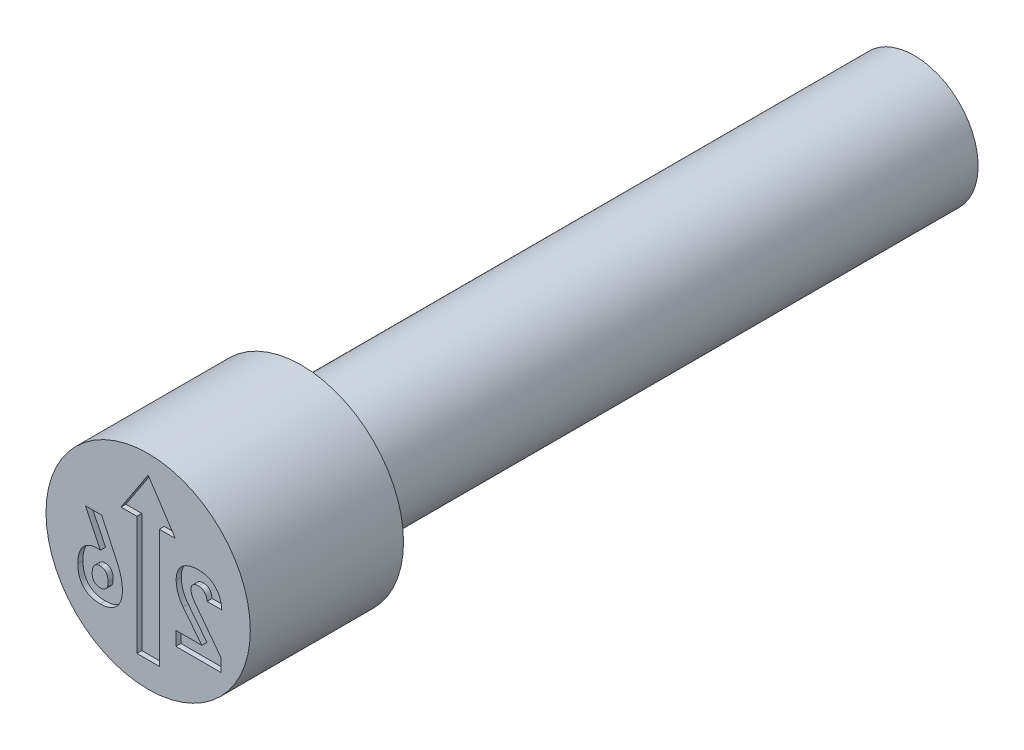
ISO-10303-21;
HEADER;
FILE_DESCRIPTION(('STEP AP214'),'2;1');
FILE_NAME('part.step','',(''),(''),'','','');
FILE_SCHEMA(('AUTOMOTIVE_DESIGN { 1 0 10303 214 1 1 1 1 }'));
ENDSEC;
DATA;
#1=APPLICATION_CONTEXT('core data for automotive mechanical design processes');
#2=APPLICATION_PROTOCOL_DEFINITION('international standard','automotive_design',2000,#1);
#3=PRODUCT_CONTEXT('',#1,'mechanical');
#4=PRODUCT('Part','Part','',(#3));
#5=PRODUCT_RELATED_PRODUCT_CATEGORY('part','',(#4));
#6=PRODUCT_DEFINITION_FORMATION('','',#4);
#7=PRODUCT_DEFINITION_CONTEXT('part definition',#1,'design');
#8=PRODUCT_DEFINITION('design','',#6,#7);
#9=PRODUCT_DEFINITION_SHAPE('','',#8);
#10=(LENGTH_UNIT() NAMED_UNIT(*) SI_UNIT(.MILLI.,.METRE.));
#11=(NAMED_UNIT(*) PLANE_ANGLE_UNIT() SI_UNIT($,.RADIAN.));
#12=(NAMED_UNIT(*) SI_UNIT($,.STERADIAN.) SOLID_ANGLE_UNIT());
#13=UNCERTAINTY_MEASURE_WITH_UNIT(LENGTH_MEASURE(1.E-05),#10,'distance_accuracy_value','');
#14=(GEOMETRIC_REPRESENTATION_CONTEXT(3) GLOBAL_UNCERTAINTY_ASSIGNED_CONTEXT((#13)) GLOBAL_UNIT_ASSIGNED_CONTEXT((#10,
#11,#12)) REPRESENTATION_CONTEXT('',''));
#15=CARTESIAN_POINT('',(0.,0.,0.));
#16=DIRECTION('',(0.,0.,1.));
#17=DIRECTION('',(1.,0.,0.));
#18=AXIS2_PLACEMENT_3D('',#15,#16,#17);
#19=CARTESIAN_POINT('',(0.999998,0.,0.));
#20=DIRECTION('',(0.,0.,1.));
#21=DIRECTION('',(1.,0.,0.));
#22=AXIS2_PLACEMENT_3D('',#19,#20,#21);
#23=PLANE('',#22);
#24=CARTESIAN_POINT('',(-1.37770238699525,-0.557122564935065,0.));
#25=CARTESIAN_POINT('',(-1.3773750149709,-0.574894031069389,0.));
#26=CARTESIAN_POINT('',(-1.37673547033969,-0.60961185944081,0.));
#27=CARTESIAN_POINT('',(-1.37109416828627,-0.660069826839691,0.));
#28=CARTESIAN_POINT('',(-1.36245049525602,-0.707564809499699,0.));
#29=CARTESIAN_POINT('',(-1.34997152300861,-0.751922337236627,0.));
#30=CARTESIAN_POINT('',(-1.33382937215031,-0.79325263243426,0.));
#31=CARTESIAN_POINT('',(-1.3139989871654,-0.831569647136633,0.));
#32=CARTESIAN_POINT('',(-1.29038913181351,-0.866684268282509,0.));
#33=CARTESIAN_POINT('',(-1.26367127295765,-0.898851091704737,0.));
#34=CARTESIAN_POINT('',(-1.23334830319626,-0.927156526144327,0.));
#35=CARTESIAN_POINT('',(-1.2002335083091,-0.95202775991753,0.));
#36=CARTESIAN_POINT('',(-1.16421035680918,-0.973277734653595,0.));
#37=CARTESIAN_POINT('',(-1.12474552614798,-0.989808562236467,0.));
#38=CARTESIAN_POINT('',(-1.08274185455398,-1.00337843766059,0.));
#39=CARTESIAN_POINT('',(-1.03762120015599,-1.01259601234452,0.));
#40=CARTESIAN_POINT('',(-0.989776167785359,-1.01858864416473,0.));
#41=CARTESIAN_POINT('',(-0.956861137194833,-1.01917840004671,0.));
#42=CARTESIAN_POINT('',(-0.939999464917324,-1.01948051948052,0.));
#43=B_SPLINE_CURVE_WITH_KNOTS('',3,(#24,#25,#26,#27,#28,#29,#30,#31,#32,#33,#34,#35,#36,#37,#38,
#39,#40,#41,#42),.UNSPECIFIED.,.F.,.F.,(4,1,1,1,1,1,1,1,1,1,1,1,1,1,1,1,4),(0.,
0.0736363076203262,0.143853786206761,0.210167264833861,0.273535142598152,0.334525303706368,
0.393774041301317,0.451974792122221,0.509587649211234,0.566708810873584,0.623480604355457,
0.680964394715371,0.739551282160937,0.800463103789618,0.863640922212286,0.930146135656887,1.),.UNSPECIFIED.);
#44=CARTESIAN_POINT('',(-1.37770238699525,-0.557122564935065,0.));
#45=VERTEX_POINT('',#44);
#46=CARTESIAN_POINT('',(-0.939999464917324,-1.01948051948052,0.));
#47=VERTEX_POINT('',#46);
#48=EDGE_CURVE('E54',#45,#47,#43,.T.);
#49=ORIENTED_EDGE('',*,*,#48,.F.);
#50=DIRECTION('',(0.,-1.,0.));
#51=VECTOR('',#50,1.);
#52=CARTESIAN_POINT('',(-1.37770238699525,-0.555905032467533,0.));
#53=LINE('',#52,#51);
#54=CARTESIAN_POINT('',(-1.37770238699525,-0.555905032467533,0.));
#55=VERTEX_POINT('',#54);
#56=EDGE_CURVE('E425',#55,#45,#53,.T.);
#57=ORIENTED_EDGE('',*,*,#56,.F.);
#58=CARTESIAN_POINT('',(-0.988396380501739,-0.103896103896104,0.));
#59=CARTESIAN_POINT('',(-1.00342757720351,-0.104236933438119,0.));
#60=CARTESIAN_POINT('',(-1.03268210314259,-0.104900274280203,0.));
#61=CARTESIAN_POINT('',(-1.07524990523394,-0.110327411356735,0.));
#62=CARTESIAN_POINT('',(-1.11503271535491,-0.119944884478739,0.));
#63=CARTESIAN_POINT('',(-1.15253133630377,-0.132569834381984,0.));
#64=CARTESIAN_POINT('',(-1.18735207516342,-0.149405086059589,0.));
#65=CARTESIAN_POINT('',(-1.21958128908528,-0.170004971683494,0.));
#66=CARTESIAN_POINT('',(-1.24929409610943,-0.194122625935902,0.));
#67=CARTESIAN_POINT('',(-1.27609889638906,-0.222047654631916,0.));
#68=CARTESIAN_POINT('',(-1.30024705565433,-0.253067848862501,0.));
#69=CARTESIAN_POINT('',(-1.3209410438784,-0.287496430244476,0.));
#70=CARTESIAN_POINT('',(-1.33872486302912,-0.32475821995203,0.));
#71=CARTESIAN_POINT('',(-1.35289273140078,-0.365225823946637,0.));
#72=CARTESIAN_POINT('',(-1.36424764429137,-0.408570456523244,0.));
#73=CARTESIAN_POINT('',(-1.37191472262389,-0.455038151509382,0.));
#74=CARTESIAN_POINT('',(-1.37698525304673,-0.504452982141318,0.));
#75=CARTESIAN_POINT('',(-1.3774589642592,-0.538440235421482,0.));
#76=CARTESIAN_POINT('',(-1.37770238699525,-0.555905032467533,0.));
#77=B_SPLINE_CURVE_WITH_KNOTS('',3,(#58,#59,#60,#61,#62,#63,#64,#65,#66,#67,#68,#69,#70,#71,#72,
#73,#74,#75,#76),.UNSPECIFIED.,.F.,.F.,(4,1,1,1,1,1,1,1,1,1,1,1,1,1,1,1,4),(0.,
0.0665766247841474,0.12957501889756,0.189644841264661,0.247639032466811,0.304530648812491,
0.36051483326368,0.416743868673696,0.473642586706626,0.531631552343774,0.590524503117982,
0.65124161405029,0.714220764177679,0.780176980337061,0.849489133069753,0.922658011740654,1.),.UNSPECIFIED.);
#78=CARTESIAN_POINT('',(-0.988396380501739,-0.103896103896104,0.));
#79=VERTEX_POINT('',#78);
#80=EDGE_CURVE('E417',#79,#55,#77,.T.);
#81=ORIENTED_EDGE('',*,*,#80,.F.);
#82=CARTESIAN_POINT('',(-0.798156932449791,-0.206168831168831,0.));
#83=CARTESIAN_POINT('',(-0.802768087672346,-0.197977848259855,0.));
#84=CARTESIAN_POINT('',(-0.811805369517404,-0.181924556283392,0.));
#85=CARTESIAN_POINT('',(-0.829607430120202,-0.161147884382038,0.));
#86=CARTESIAN_POINT('',(-0.849461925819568,-0.143105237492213,0.));
#87=CARTESIAN_POINT('',(-0.872423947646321,-0.128754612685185,0.));
#88=CARTESIAN_POINT('',(-0.897812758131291,-0.11740102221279,0.));
#89=CARTESIAN_POINT('',(-0.925836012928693,-0.109660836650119,0.));
#90=CARTESIAN_POINT('',(-0.956251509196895,-0.104582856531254,0.));
#91=CARTESIAN_POINT('',(-0.977416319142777,-0.104130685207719,0.));
#92=CARTESIAN_POINT('',(-0.988396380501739,-0.103896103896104,0.));
#93=B_SPLINE_CURVE_WITH_KNOTS('',3,(#82,#83,#84,#85,#86,#87,#88,#89,#90,#91,#92),.UNSPECIFIED.,
.F.,.F.,(4,1,1,1,1,1,1,1,4),(0.,0.123274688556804,0.24160281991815,0.357777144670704,
0.474683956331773,0.595870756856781,0.722082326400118,0.855819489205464,1.),.UNSPECIFIED.);
#94=CARTESIAN_POINT('',(-0.934291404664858,-0.108459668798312,0.));
#95=VERTEX_POINT('',#94);
#96=EDGE_CURVE('E412',#95,#79,#93,.T.);
#97=ORIENTED_EDGE('',*,*,#96,.F.);
#98=DIRECTION('',(0.435377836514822,-0.900247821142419,0.));
#99=VECTOR('',#98,1.);
#100=CARTESIAN_POINT('',(-1.22855465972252,0.5,0.));
#101=LINE('',#100,#99);
#102=CARTESIAN_POINT('',(-1.22855465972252,0.5,0.));
#103=VERTEX_POINT('',#102);
#104=EDGE_CURVE('E409',#103,#95,#101,.T.);
#105=ORIENTED_EDGE('',*,*,#104,.F.);
#106=DIRECTION('',(-1.,0.,0.));
#107=VECTOR('',#106,1.);
#108=CARTESIAN_POINT('',(-0.910169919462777,0.5,0.));
#109=LINE('',#108,#107);
#110=CARTESIAN_POINT('',(-0.910169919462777,0.5,0.));
#111=VERTEX_POINT('',#110);
#112=EDGE_CURVE('E406',#111,#103,#109,.T.);
#113=ORIENTED_EDGE('',*,*,#112,.F.);
#114=DIRECTION('',(-0.42407385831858,0.905627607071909,0.));
#115=VECTOR('',#114,1.);
#116=CARTESIAN_POINT('',(-0.607004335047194,-0.14742288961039,0.));
#117=LINE('',#116,#115);
#118=CARTESIAN_POINT('',(-0.607004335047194,-0.14742288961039,0.));
#119=VERTEX_POINT('',#118);
#120=EDGE_CURVE('E400',#119,#111,#117,.T.);
#121=ORIENTED_EDGE('',*,*,#120,.F.);
#122=CARTESIAN_POINT('',(-0.503514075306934,-0.56442775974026,0.));
#123=CARTESIAN_POINT('',(-0.503898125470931,-0.54797806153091,0.));
#124=CARTESIAN_POINT('',(-0.504679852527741,-0.514495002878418,0.));
#125=CARTESIAN_POINT('',(-0.510131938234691,-0.463675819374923,0.));
#126=CARTESIAN_POINT('',(-0.518556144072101,-0.411497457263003,0.));
#127=CARTESIAN_POINT('',(-0.530912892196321,-0.358426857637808,0.));
#128=CARTESIAN_POINT('',(-0.545980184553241,-0.305007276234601,0.));
#129=CARTESIAN_POINT('',(-0.563829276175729,-0.251853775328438,0.));
#130=CARTESIAN_POINT('',(-0.583676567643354,-0.199091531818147,0.));
#131=CARTESIAN_POINT('',(-0.599206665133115,-0.164693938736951,0.));
#132=CARTESIAN_POINT('',(-0.607004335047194,-0.14742288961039,0.));
#133=B_SPLINE_CURVE_WITH_KNOTS('',3,(#122,#123,#124,#125,#126,#127,#128,#129,#130,#131,#132),
.UNSPECIFIED.,.F.,.F.,(4,1,1,1,1,1,1,1,4),(0.,0.114002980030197,0.232050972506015,
0.353906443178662,0.480147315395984,0.609491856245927,0.738474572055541,0.868687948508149,1.),.UNSPECIFIED.);
#134=CARTESIAN_POINT('',(-0.503514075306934,-0.56442775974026,0.));
#135=VERTEX_POINT('',#134);
#136=EDGE_CURVE('E395',#135,#119,#133,.T.);
#137=ORIENTED_EDGE('',*,*,#136,.F.);
#138=DIRECTION('',(0.,1.,0.));
#139=VECTOR('',#138,1.);
#140=CARTESIAN_POINT('',(-0.503514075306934,-0.565340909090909,0.));
#141=LINE('',#140,#139);
#142=CARTESIAN_POINT('',(-0.503514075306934,-0.565340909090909,0.));
#143=VERTEX_POINT('',#142);
#144=EDGE_CURVE('E389',#143,#135,#141,.T.);
#145=ORIENTED_EDGE('',*,*,#144,.F.);
#146=CARTESIAN_POINT('',(-0.939999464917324,-1.01948051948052,0.));
#147=CARTESIAN_POINT('',(-0.923142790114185,-1.01914240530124,0.));
#148=CARTESIAN_POINT('',(-0.890350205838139,-1.01848464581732,0.));
#149=CARTESIAN_POINT('',(-0.842645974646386,-1.01303094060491,0.));
#150=CARTESIAN_POINT('',(-0.797929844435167,-1.00355814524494,0.));
#151=CARTESIAN_POINT('',(-0.756005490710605,-0.990485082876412,0.));
#152=CARTESIAN_POINT('',(-0.716871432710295,-0.973773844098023,0.));
#153=CARTESIAN_POINT('',(-0.680701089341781,-0.953286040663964,0.));
#154=CARTESIAN_POINT('',(-0.647476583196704,-0.929007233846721,0.));
#155=CARTESIAN_POINT('',(-0.617365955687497,-0.900989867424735,0.));
#156=CARTESIAN_POINT('',(-0.590580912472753,-0.8695834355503,0.));
#157=CARTESIAN_POINT('',(-0.567184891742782,-0.835094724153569,0.));
#158=CARTESIAN_POINT('',(-0.547375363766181,-0.79753491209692,0.));
#159=CARTESIAN_POINT('',(-0.531308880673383,-0.756884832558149,0.));
#160=CARTESIAN_POINT('',(-0.518707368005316,-0.71326964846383,0.));
#161=CARTESIAN_POINT('',(-0.510184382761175,-0.666659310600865,0.));
#162=CARTESIAN_POINT('',(-0.504444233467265,-0.617025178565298,0.));
#163=CARTESIAN_POINT('',(-0.50383028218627,-0.582910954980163,0.));
#164=CARTESIAN_POINT('',(-0.503514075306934,-0.565340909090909,0.));
#165=B_SPLINE_CURVE_WITH_KNOTS('',3,(#146,#147,#148,#149,#150,#151,#152,#153,#154,#155,#156,
#157,#158,#159,#160,#161,#162,#163,#164),.UNSPECIFIED.,.F.,.F.,(4,1,1,1,1,1,1,1,1,1,1,1,1,1,1,1,
4),(0.,0.0706034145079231,0.137350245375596,0.20079014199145,0.261822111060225,
0.321037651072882,0.37871381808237,0.435588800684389,0.493032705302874,0.550614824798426,
0.60814515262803,0.667276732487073,0.728130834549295,0.790952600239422,0.857142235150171,
0.926423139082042,1.),.UNSPECIFIED.);
#166=EDGE_CURVE('E381',#47,#143,#165,.T.);
#167=ORIENTED_EDGE('',*,*,#166,.F.);
#168=EDGE_LOOP('',(#49,#57,#81,#97,#105,#113,#121,#137,#145,#167));
#169=FACE_BOUND('',#168,.T.);
#170=DIRECTION('',(1.,0.,0.));
#171=VECTOR('',#170,1.);
#172=CARTESIAN_POINT('',(0.540532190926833,-1.,0.));
#173=LINE('',#172,#171);
#174=CARTESIAN_POINT('',(0.540532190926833,-1.,0.));
#175=VERTEX_POINT('',#174);
#176=CARTESIAN_POINT('',(1.42385199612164,-1.,0.));
#177=VERTEX_POINT('',#176);
#178=EDGE_CURVE('E434',#175,#177,#173,.T.);
#179=ORIENTED_EDGE('',*,*,#178,.F.);
#180=DIRECTION('',(0.,-1.,0.));
#181=VECTOR('',#180,1.);
#182=CARTESIAN_POINT('',(0.540532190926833,-0.727272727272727,0.));
#183=LINE('',#182,#181);
#184=CARTESIAN_POINT('',(0.540532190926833,-0.727272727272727,0.));
#185=VERTEX_POINT('',#184);
#186=EDGE_CURVE('E456',#185,#175,#183,.T.);
#187=ORIENTED_EDGE('',*,*,#186,.F.);
#188=DIRECTION('',(-1.,0.,0.));
#189=VECTOR('',#188,1.);
#190=CARTESIAN_POINT('',(1.05098267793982,-0.727272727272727,0.));
#191=LINE('',#190,#189);
#192=CARTESIAN_POINT('',(1.05098267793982,-0.727272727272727,0.));
#193=VERTEX_POINT('',#192);
#194=EDGE_CURVE('E673',#193,#185,#191,.T.);
#195=ORIENTED_EDGE('',*,*,#194,.F.);
#196=DIRECTION('',(0.618183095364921,-0.786034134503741,0.));
#197=VECTOR('',#196,1.);
#198=CARTESIAN_POINT('',(0.683287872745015,-0.25974025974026,0.));
#199=LINE('',#198,#197);
#200=CARTESIAN_POINT('',(0.683287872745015,-0.25974025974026,0.));
#201=VERTEX_POINT('',#200);
#202=EDGE_CURVE('E676',#201,#193,#199,.T.);
#203=ORIENTED_EDGE('',*,*,#202,.F.);
#204=CARTESIAN_POINT('',(0.548750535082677,0.126217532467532,0.));
#205=CARTESIAN_POINT('',(0.549138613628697,0.10915031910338,0.));
#206=CARTESIAN_POINT('',(0.549915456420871,0.0749857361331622,0.));
#207=CARTESIAN_POINT('',(0.5569277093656,0.0238536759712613,0.));
#208=CARTESIAN_POINT('',(0.5682278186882,-0.0270173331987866,0.));
#209=CARTESIAN_POINT('',(0.583746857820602,-0.077381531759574,0.));
#210=CARTESIAN_POINT('',(0.603025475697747,-0.126366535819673,0.));
#211=CARTESIAN_POINT('',(0.626163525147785,-0.173301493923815,0.));
#212=CARTESIAN_POINT('',(0.652277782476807,-0.218207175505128,0.));
#213=CARTESIAN_POINT('',(0.672970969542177,-0.245922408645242,0.));
#214=CARTESIAN_POINT('',(0.683287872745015,-0.25974025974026,0.));
#215=B_SPLINE_CURVE_WITH_KNOTS('',3,(#204,#205,#206,#207,#208,#209,#210,#211,#212,#213,#214),
.UNSPECIFIED.,.F.,.F.,(4,1,1,1,1,1,1,1,4),(0.,0.123046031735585,0.246309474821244,
0.371480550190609,0.498560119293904,0.626024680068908,0.750715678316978,0.875715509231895,1.),.UNSPECIFIED.);
#216=CARTESIAN_POINT('',(0.548750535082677,0.126217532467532,0.));
#217=VERTEX_POINT('',#216);
#218=EDGE_CURVE('E679',#217,#201,#215,.T.);
#219=ORIENTED_EDGE('',*,*,#218,.F.);
#220=DIRECTION('',(0.,-1.,0.));
#221=VECTOR('',#220,1.);
#222=CARTESIAN_POINT('',(0.548750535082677,0.127435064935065,0.));
#223=LINE('',#222,#221);
#224=CARTESIAN_POINT('',(0.548750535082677,0.127435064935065,0.));
#225=VERTEX_POINT('',#224);
#226=EDGE_CURVE('E684',#225,#217,#223,.T.);
#227=ORIENTED_EDGE('',*,*,#226,.F.);
#228=CARTESIAN_POINT('',(0.990410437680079,0.519480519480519,0.));
#229=CARTESIAN_POINT('',(0.973351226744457,0.519238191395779,0.));
#230=CARTESIAN_POINT('',(0.940173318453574,0.518766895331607,0.));
#231=CARTESIAN_POINT('',(0.89187202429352,0.513679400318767,0.));
#232=CARTESIAN_POINT('',(0.84642562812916,0.506000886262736,0.));
#233=CARTESIAN_POINT('',(0.803907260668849,0.494767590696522,0.));
#234=CARTESIAN_POINT('',(0.764487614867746,0.480114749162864,0.));
#235=CARTESIAN_POINT('',(0.728048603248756,0.462447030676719,0.));
#236=CARTESIAN_POINT('',(0.694514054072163,0.441613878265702,0.));
#237=CARTESIAN_POINT('',(0.664140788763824,0.417570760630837,0.));
#238=CARTESIAN_POINT('',(0.636812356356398,0.390754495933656,0.));
#239=CARTESIAN_POINT('',(0.613289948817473,0.360892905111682,0.));
#240=CARTESIAN_POINT('',(0.592927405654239,0.328589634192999,0.));
#241=CARTESIAN_POINT('',(0.577010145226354,0.293218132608,0.));
#242=CARTESIAN_POINT('',(0.563905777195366,0.255610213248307,0.));
#243=CARTESIAN_POINT('',(0.555420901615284,0.215091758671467,0.));
#244=CARTESIAN_POINT('',(0.549703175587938,0.172139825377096,0.));
#245=CARTESIAN_POINT('',(0.549073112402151,0.142572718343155,0.));
#246=CARTESIAN_POINT('',(0.548750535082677,0.127435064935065,0.));
#247=B_SPLINE_CURVE_WITH_KNOTS('',3,(#228,#229,#230,#231,#232,#233,#234,#235,#236,#237,#238,
#239,#240,#241,#242,#243,#244,#245,#246),.UNSPECIFIED.,.F.,.F.,(4,1,1,1,1,1,1,1,1,1,1,1,1,1,1,1,
4),(0.,0.0762312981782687,0.148259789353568,0.216860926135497,0.28210063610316,
0.344528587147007,0.404571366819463,0.462840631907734,0.520642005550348,0.577409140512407,
0.633580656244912,0.690215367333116,0.747647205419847,0.806597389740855,0.867894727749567,
0.932365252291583,1.),.UNSPECIFIED.);
#248=CARTESIAN_POINT('',(0.990410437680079,0.519480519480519,0.));
#249=VERTEX_POINT('',#248);
#250=EDGE_CURVE('E690',#249,#225,#247,.T.);
#251=ORIENTED_EDGE('',*,*,#250,.F.);
#252=CARTESIAN_POINT('',(1.44241936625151,0.0692978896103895,0.));
#253=CARTESIAN_POINT('',(1.44099552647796,0.0866849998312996,0.));
#254=CARTESIAN_POINT('',(1.4382162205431,0.120624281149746,0.));
#255=CARTESIAN_POINT('',(1.42910444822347,0.169719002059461,0.));
#256=CARTESIAN_POINT('',(1.41732784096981,0.215962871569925,0.));
#257=CARTESIAN_POINT('',(1.40234640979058,0.259346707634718,0.));
#258=CARTESIAN_POINT('',(1.38309521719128,0.29936817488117,0.));
#259=CARTESIAN_POINT('',(1.36146591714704,0.3368639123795,0.));
#260=CARTESIAN_POINT('',(1.33545128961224,0.370674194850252,0.));
#261=CARTESIAN_POINT('',(1.30697463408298,0.401930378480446,0.));
#262=CARTESIAN_POINT('',(1.27525673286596,0.429460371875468,0.));
#263=CARTESIAN_POINT('',(1.24143673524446,0.453745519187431,0.));
#264=CARTESIAN_POINT('',(1.20500322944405,0.473954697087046,0.));
#265=CARTESIAN_POINT('',(1.16651010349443,0.490719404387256,0.));
#266=CARTESIAN_POINT('',(1.12553057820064,0.503443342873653,0.));
#267=CARTESIAN_POINT('',(1.08259994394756,0.51297454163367,0.));
#268=CARTESIAN_POINT('',(1.03722543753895,0.518471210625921,0.));
#269=CARTESIAN_POINT('',(1.00625306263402,0.519138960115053,0.));
#270=CARTESIAN_POINT('',(0.990410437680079,0.519480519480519,0.));
#271=B_SPLINE_CURVE_WITH_KNOTS('',3,(#252,#253,#254,#255,#256,#257,#258,#259,#260,#261,#262,
#263,#264,#265,#266,#267,#268,#269,#270),.UNSPECIFIED.,.F.,.F.,(4,1,1,1,1,1,1,1,1,1,1,1,1,1,1,1,
4),(0.,0.0733268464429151,0.14313249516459,0.209679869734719,0.273918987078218,0.33576228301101,
0.396210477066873,0.45560885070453,0.514796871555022,0.573764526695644,0.631900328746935,
0.689592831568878,0.748648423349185,0.808163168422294,0.86976604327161,0.933384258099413,1.),.UNSPECIFIED.);
#272=CARTESIAN_POINT('',(1.44241936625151,0.0692978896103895,0.));
#273=VERTEX_POINT('',#272);
#274=EDGE_CURVE('E695',#273,#249,#271,.T.);
#275=ORIENTED_EDGE('',*,*,#274,.F.);
#276=DIRECTION('',(0.,1.,0.));
#277=VECTOR('',#276,1.);
#278=CARTESIAN_POINT('',(1.44241936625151,0.0683847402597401,0.));
#279=LINE('',#278,#277);
#280=CARTESIAN_POINT('',(1.44241936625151,0.0683847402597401,0.));
#281=VERTEX_POINT('',#280);
#282=EDGE_CURVE('E703',#281,#273,#279,.T.);
#283=ORIENTED_EDGE('',*,*,#282,.F.);
#284=DIRECTION('',(1.,0.,0.));
#285=VECTOR('',#284,1.);
#286=CARTESIAN_POINT('',(1.15386417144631,0.0683847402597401,0.));
#287=LINE('',#286,#285);
#288=CARTESIAN_POINT('',(1.15386417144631,0.0683847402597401,0.));
#289=VERTEX_POINT('',#288);
#290=EDGE_CURVE('E709',#289,#281,#287,.T.);
#291=ORIENTED_EDGE('',*,*,#290,.F.);
#292=DIRECTION('',(0.,-1.,0.));
#293=VECTOR('',#292,1.);
#294=CARTESIAN_POINT('',(1.15386417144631,0.0692978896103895,0.));
#295=LINE('',#294,#293);
#296=CARTESIAN_POINT('',(1.15386417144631,0.0692978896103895,0.));
#297=VERTEX_POINT('',#296);
#298=EDGE_CURVE('E712',#297,#289,#295,.T.);
#299=ORIENTED_EDGE('',*,*,#298,.F.);
#300=CARTESIAN_POINT('',(0.988279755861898,0.246753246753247,0.));
#301=CARTESIAN_POINT('',(0.999306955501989,0.246322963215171,0.));
#302=CARTESIAN_POINT('',(1.02073318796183,0.245486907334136,0.));
#303=CARTESIAN_POINT('',(1.05106567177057,0.236221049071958,0.));
#304=CARTESIAN_POINT('',(1.07839819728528,0.221686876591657,0.));
#305=CARTESIAN_POINT('',(1.10196100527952,0.200948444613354,0.));
#306=CARTESIAN_POINT('',(1.12147279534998,0.174910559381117,0.));
#307=CARTESIAN_POINT('',(1.13730850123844,0.14424880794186,0.));
#308=CARTESIAN_POINT('',(1.14806399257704,0.108409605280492,0.));
#309=CARTESIAN_POINT('',(1.15186856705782,0.0827546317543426,0.));
#310=CARTESIAN_POINT('',(1.15386417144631,0.0692978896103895,0.));
#311=B_SPLINE_CURVE_WITH_KNOTS('',3,(#300,#301,#302,#303,#304,#305,#306,#307,#308,#309,#310),
.UNSPECIFIED.,.F.,.F.,(4,1,1,1,1,1,1,1,4),(0.,0.122603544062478,0.238222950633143,
0.350089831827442,0.46555970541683,0.58502806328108,0.711014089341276,0.848418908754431,1.),.UNSPECIFIED.);
#312=CARTESIAN_POINT('',(0.988279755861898,0.246753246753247,0.));
#313=VERTEX_POINT('',#312);
#314=EDGE_CURVE('E715',#313,#297,#311,.T.);
#315=ORIENTED_EDGE('',*,*,#314,.F.);
#316=CARTESIAN_POINT('',(0.838523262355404,0.119521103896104,0.));
#317=CARTESIAN_POINT('',(0.838939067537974,0.129111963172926,0.));
#318=CARTESIAN_POINT('',(0.839735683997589,0.14748652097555,0.));
#319=CARTESIAN_POINT('',(0.847241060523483,0.173376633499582,0.));
#320=CARTESIAN_POINT('',(0.859541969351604,0.195922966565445,0.));
#321=CARTESIAN_POINT('',(0.877159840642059,0.214546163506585,0.));
#322=CARTESIAN_POINT('',(0.899092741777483,0.229275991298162,0.));
#323=CARTESIAN_POINT('',(0.925336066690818,0.239656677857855,0.));
#324=CARTESIAN_POINT('',(0.955546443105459,0.245609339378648,0.));
#325=CARTESIAN_POINT('',(0.976989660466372,0.246358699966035,0.));
#326=CARTESIAN_POINT('',(0.988279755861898,0.246753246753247,0.));
#327=B_SPLINE_CURVE_WITH_KNOTS('',3,(#316,#317,#318,#319,#320,#321,#322,#323,#324,#325,#326),
.UNSPECIFIED.,.F.,.F.,(4,1,1,1,1,1,1,1,4),(0.,0.128749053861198,0.246662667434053,
0.359069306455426,0.47107757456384,0.588039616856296,0.711712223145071,0.848213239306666,1.),.UNSPECIFIED.);
#328=CARTESIAN_POINT('',(0.838523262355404,0.119521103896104,0.));
#329=VERTEX_POINT('',#328);
#330=EDGE_CURVE('E720',#329,#313,#327,.T.);
#331=ORIENTED_EDGE('',*,*,#330,.F.);
#332=DIRECTION('',(0.,1.,0.));
#333=VECTOR('',#332,1.);
#334=CARTESIAN_POINT('',(0.838523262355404,0.117390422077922,0.));
#335=LINE('',#334,#333);
#336=CARTESIAN_POINT('',(0.838523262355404,0.117390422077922,0.));
#337=VERTEX_POINT('',#336);
#338=EDGE_CURVE('E728',#337,#329,#335,.T.);
#339=ORIENTED_EDGE('',*,*,#338,.F.);
#340=CARTESIAN_POINT('',(0.911270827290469,-0.0658482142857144,0.));
#341=CARTESIAN_POINT('',(0.900534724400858,-0.0507204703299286,0.));
#342=CARTESIAN_POINT('',(0.879615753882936,-0.0212445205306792,0.));
#343=CARTESIAN_POINT('',(0.860682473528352,0.0192347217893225,0.));
#344=CARTESIAN_POINT('',(0.848887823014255,0.0509709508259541,0.));
#345=CARTESIAN_POINT('',(0.843266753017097,0.0739859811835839,0.));
#346=CARTESIAN_POINT('',(0.839256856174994,0.0959444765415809,0.));
#347=CARTESIAN_POINT('',(0.838763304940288,0.110372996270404,0.));
#348=CARTESIAN_POINT('',(0.838523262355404,0.117390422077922,0.));
#349=B_SPLINE_CURVE_WITH_KNOTS('',3,(#340,#341,#342,#343,#344,#345,#346,#347,#348),
.UNSPECIFIED.,.F.,.F.,(4,1,1,1,1,1,4),(0.,0.27737542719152,0.540457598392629,0.666416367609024,
0.784009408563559,0.894951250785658,1.),.UNSPECIFIED.);
#350=CARTESIAN_POINT('',(0.911270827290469,-0.0658482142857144,0.));
#351=VERTEX_POINT('',#350);
#352=EDGE_CURVE('E734',#351,#337,#349,.T.);
#353=ORIENTED_EDGE('',*,*,#352,.F.);
#354=DIRECTION('',(-0.602458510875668,0.798150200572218,0.));
#355=VECTOR('',#354,1.);
#356=CARTESIAN_POINT('',(1.42385199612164,-0.744926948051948,0.));
#357=LINE('',#356,#355);
#358=CARTESIAN_POINT('',(1.42385199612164,-0.744926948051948,0.));
#359=VERTEX_POINT('',#358);
#360=EDGE_CURVE('E739',#359,#351,#357,.T.);
#361=ORIENTED_EDGE('',*,*,#360,.F.);
#362=DIRECTION('',(0.,1.,0.));
#363=VECTOR('',#362,1.);
#364=CARTESIAN_POINT('',(1.42385199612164,-1.,0.));
#365=LINE('',#364,#363);
#366=EDGE_CURVE('E745',#177,#359,#365,.T.);
#367=ORIENTED_EDGE('',*,*,#366,.F.);
#368=EDGE_LOOP('',(#179,#187,#195,#203,#219,#227,#251,#275,#283,#291,#299,#315,#331,#339,#353,
#361,#367));
#369=FACE_BOUND('',#368,.T.);
#370=CARTESIAN_POINT('',(0.,0.,0.));
#371=DIRECTION('',(0.,0.,-1.));
#372=DIRECTION('',(-1.,0.,0.));
#373=AXIS2_PLACEMENT_3D('',#370,#371,#372);
#374=CIRCLE('',#373,1.999996);
#375=CARTESIAN_POINT('',(-1.999996,0.,0.));
#376=VERTEX_POINT('',#375);
#377=EDGE_CURVE('E41',#376,#376,#374,.T.);
#378=ORIENTED_EDGE('',*,*,#377,.F.);
#379=EDGE_LOOP('',(#378));
#380=FACE_BOUND('',#379,.T.);
#381=DIRECTION('',(0.,1.,0.));
#382=VECTOR('',#381,1.);
#383=CARTESIAN_POINT('',(0.22,0.,0.));
#384=LINE('',#383,#382);
#385=CARTESIAN_POINT('',(0.22,0.825524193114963,0.));
#386=VERTEX_POINT('',#385);
#387=CARTESIAN_POINT('',(0.22,-1.5,0.));
#388=VERTEX_POINT('',#387);
#389=EDGE_CURVE('E564',#386,#388,#384,.F.);
#390=ORIENTED_EDGE('',*,*,#389,.T.);
#391=DIRECTION('',(1.,0.,0.));
#392=VECTOR('',#391,1.);
#393=CARTESIAN_POINT('',(0.999998,-1.5,0.));
#394=LINE('',#393,#392);
#395=CARTESIAN_POINT('',(-0.22,-1.5,0.));
#396=VERTEX_POINT('',#395);
#397=EDGE_CURVE('E567',#388,#396,#394,.F.);
#398=ORIENTED_EDGE('',*,*,#397,.T.);
#399=DIRECTION('',(0.,1.,0.));
#400=VECTOR('',#399,1.);
#401=CARTESIAN_POINT('',(-0.22,0.,0.));
#402=LINE('',#401,#400);
#403=CARTESIAN_POINT('',(-0.22,0.825524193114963,0.));
#404=VERTEX_POINT('',#403);
#405=EDGE_CURVE('E585',#396,#404,#402,.T.);
#406=ORIENTED_EDGE('',*,*,#405,.T.);
#407=DIRECTION('',(1.,0.,0.));
#408=VECTOR('',#407,1.);
#409=CARTESIAN_POINT('',(0.999998,0.825524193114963,0.));
#410=LINE('',#409,#408);
#411=CARTESIAN_POINT('',(-0.532051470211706,0.825524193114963,0.));
#412=VERTEX_POINT('',#411);
#413=EDGE_CURVE('E582',#404,#412,#410,.F.);
#414=ORIENTED_EDGE('',*,*,#413,.T.);
#415=DIRECTION('',(0.550159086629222,0.835059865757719,0.));
#416=VECTOR('',#415,1.);
#417=CARTESIAN_POINT('',(-0.532051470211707,0.825524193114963,0.));
#418=LINE('',#417,#416);
#419=CARTESIAN_POINT('',(0.,1.63309938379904,0.));
#420=VERTEX_POINT('',#419);
#421=EDGE_CURVE('E579',#412,#420,#418,.T.);
#422=ORIENTED_EDGE('',*,*,#421,.T.);
#423=DIRECTION('',(0.550159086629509,-0.83505986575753,0.));
#424=VECTOR('',#423,1.);
#425=CARTESIAN_POINT('',(0.,1.63309938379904,0.));
#426=LINE('',#425,#424);
#427=CARTESIAN_POINT('',(0.532051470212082,0.825524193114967,0.));
#428=VERTEX_POINT('',#427);
#429=EDGE_CURVE('E574',#420,#428,#426,.T.);
#430=ORIENTED_EDGE('',*,*,#429,.T.);
#431=DIRECTION('',(1.,0.,0.));
#432=VECTOR('',#431,1.);
#433=CARTESIAN_POINT('',(0.999998,0.825524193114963,0.));
#434=LINE('',#433,#432);
#435=EDGE_CURVE('E570',#428,#386,#434,.F.);
#436=ORIENTED_EDGE('',*,*,#435,.T.);
#437=EDGE_LOOP('',(#390,#398,#406,#414,#422,#430,#436));
#438=FACE_BOUND('',#437,.T.);
#439=ADVANCED_FACE('F37',(#169,#369,#380,#438),#23,.T.);
#440=CARTESIAN_POINT('',(-0.22,-1.5,-2.72238250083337));
#441=DIRECTION('',(-1.,0.,0.));
#442=DIRECTION('',(0.,0.,1.));
#443=AXIS2_PLACEMENT_3D('',#440,#441,#442);
#444=PLANE('',#443);
#445=DIRECTION('',(0.,-1.,0.));
#446=VECTOR('',#445,1.);
#447=CARTESIAN_POINT('',(-0.22,0.825524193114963,-0.0955992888));
#448=LINE('',#447,#446);
#449=CARTESIAN_POINT('',(-0.22,0.825524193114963,-0.0955992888));
#450=VERTEX_POINT('',#449);
#451=CARTESIAN_POINT('',(-0.22,-1.5,-0.0955992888));
#452=VERTEX_POINT('',#451);
#453=EDGE_CURVE('E620',#450,#452,#448,.T.);
#454=ORIENTED_EDGE('',*,*,#453,.F.);
#455=DIRECTION('',(0.,0.,1.));
#456=VECTOR('',#455,1.);
#457=CARTESIAN_POINT('',(-0.22,0.825524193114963,-0.1777996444));
#458=LINE('',#457,#456);
#459=EDGE_CURVE('E601',#404,#450,#458,.F.);
#460=ORIENTED_EDGE('',*,*,#459,.F.);
#461=ORIENTED_EDGE('',*,*,#405,.F.);
#462=DIRECTION('',(0.,0.,-1.));
#463=VECTOR('',#462,1.);
#464=CARTESIAN_POINT('',(-0.22,-1.5,-2.72238250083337));
#465=LINE('',#464,#463);
#466=EDGE_CURVE('E587',#396,#452,#465,.T.);
#467=ORIENTED_EDGE('',*,*,#466,.T.);
#468=EDGE_LOOP('',(#454,#460,#461,#467));
#469=FACE_BOUND('',#468,.T.);
#470=ADVANCED_FACE('F39',(#469),#444,.F.);
#471=CARTESIAN_POINT('',(3.41059817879E-13,0.825524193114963,-0.1777996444));
#472=DIRECTION('',(0.,1.,0.));
#473=DIRECTION('',(0.,0.,1.));
#474=AXIS2_PLACEMENT_3D('',#471,#472,#473);
#475=PLANE('',#474);
#476=ORIENTED_EDGE('',*,*,#459,.T.);
#477=DIRECTION('',(1.,0.,0.));
#478=VECTOR('',#477,1.);
#479=CARTESIAN_POINT('',(-0.532051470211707,0.825524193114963,-0.0955992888));
#480=LINE('',#479,#478);
#481=CARTESIAN_POINT('',(-0.532051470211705,0.825524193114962,-0.0955992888));
#482=VERTEX_POINT('',#481);
#483=EDGE_CURVE('E625',#482,#450,#480,.T.);
#484=ORIENTED_EDGE('',*,*,#483,.F.);
#485=DIRECTION('',(0.,0.,1.));
#486=VECTOR('',#485,1.);
#487=CARTESIAN_POINT('',(-0.532051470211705,0.825524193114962,-0.8127983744));
#488=LINE('',#487,#486);
#489=EDGE_CURVE('E599',#482,#412,#488,.T.);
#490=ORIENTED_EDGE('',*,*,#489,.T.);
#491=ORIENTED_EDGE('',*,*,#413,.F.);
#492=EDGE_LOOP('',(#476,#484,#490,#491));
#493=FACE_BOUND('',#492,.T.);
#494=ADVANCED_FACE('F537',(#493),#475,.T.);
#495=CARTESIAN_POINT('',(-0.902397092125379,0.263394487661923,-0.8127983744));
#496=DIRECTION('',(-0.835059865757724,0.550159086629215,0.));
#497=DIRECTION('',(-0.550159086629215,-0.835059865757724,0.));
#498=AXIS2_PLACEMENT_3D('',#495,#496,#497);
#499=PLANE('',#498);
#500=DIRECTION('',(-0.550159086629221,-0.83505986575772,0.));
#501=VECTOR('',#500,1.);
#502=CARTESIAN_POINT('',(0.,1.63309938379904,-0.0955992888));
#503=LINE('',#502,#501);
#504=CARTESIAN_POINT('',(0.,1.63309938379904,-0.0955992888));
#505=VERTEX_POINT('',#504);
#506=EDGE_CURVE('E627',#505,#482,#503,.T.);
#507=ORIENTED_EDGE('',*,*,#506,.F.);
#508=DIRECTION('',(0.,0.,1.));
#509=VECTOR('',#508,1.);
#510=CARTESIAN_POINT('',(0.,1.63309938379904,-0.8127983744));
#511=LINE('',#510,#509);
#512=EDGE_CURVE('E597',#505,#420,#511,.T.);
#513=ORIENTED_EDGE('',*,*,#512,.T.);
#514=ORIENTED_EDGE('',*,*,#421,.F.);
#515=ORIENTED_EDGE('',*,*,#489,.F.);
#516=EDGE_LOOP('',(#507,#513,#514,#515));
#517=FACE_BOUND('',#516,.T.);
#518=ADVANCED_FACE('F534',(#517),#499,.F.);
#519=CARTESIAN_POINT('',(0.,1.63309938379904,-0.8127983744));
#520=DIRECTION('',(0.835059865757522,0.550159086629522,0.));
#521=DIRECTION('',(-0.550159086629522,0.835059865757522,0.));
#522=AXIS2_PLACEMENT_3D('',#519,#520,#521);
#523=PLANE('',#522);
#524=DIRECTION('',(-0.550159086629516,0.835059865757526,0.));
#525=VECTOR('',#524,1.);
#526=CARTESIAN_POINT('',(0.532051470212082,0.825524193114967,-0.0955992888));
#527=LINE('',#526,#525);
#528=CARTESIAN_POINT('',(0.532051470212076,0.825524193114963,-0.0955992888));
#529=VERTEX_POINT('',#528);
#530=EDGE_CURVE('E630',#529,#505,#527,.T.);
#531=ORIENTED_EDGE('',*,*,#530,.F.);
#532=DIRECTION('',(0.,0.,1.));
#533=VECTOR('',#532,1.);
#534=CARTESIAN_POINT('',(0.532051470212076,0.825524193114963,-0.1777996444));
#535=LINE('',#534,#533);
#536=EDGE_CURVE('E594',#428,#529,#535,.F.);
#537=ORIENTED_EDGE('',*,*,#536,.F.);
#538=ORIENTED_EDGE('',*,*,#429,.F.);
#539=ORIENTED_EDGE('',*,*,#512,.F.);
#540=EDGE_LOOP('',(#531,#537,#538,#539));
#541=FACE_BOUND('',#540,.T.);
#542=ADVANCED_FACE('F530',(#541),#523,.F.);
#543=CARTESIAN_POINT('',(3.41059817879E-13,0.825524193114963,-0.1777996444));
#544=DIRECTION('',(0.,1.,0.));
#545=DIRECTION('',(0.,0.,1.));
#546=AXIS2_PLACEMENT_3D('',#543,#544,#545);
#547=PLANE('',#546);
#548=ORIENTED_EDGE('',*,*,#536,.T.);
#549=DIRECTION('',(1.,0.,0.));
#550=VECTOR('',#549,1.);
#551=CARTESIAN_POINT('',(0.22,0.825524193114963,-0.0955992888));
#552=LINE('',#551,#550);
#553=CARTESIAN_POINT('',(0.22,0.825524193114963,-0.0955992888));
#554=VERTEX_POINT('',#553);
#555=EDGE_CURVE('E633',#554,#529,#552,.T.);
#556=ORIENTED_EDGE('',*,*,#555,.F.);
#557=DIRECTION('',(0.,0.,1.));
#558=VECTOR('',#557,1.);
#559=CARTESIAN_POINT('',(0.22,0.825524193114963,-2.72238250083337));
#560=LINE('',#559,#558);
#561=EDGE_CURVE('E592',#554,#386,#560,.T.);
#562=ORIENTED_EDGE('',*,*,#561,.T.);
#563=ORIENTED_EDGE('',*,*,#435,.F.);
#564=EDGE_LOOP('',(#548,#556,#562,#563));
#565=FACE_BOUND('',#564,.T.);
#566=ADVANCED_FACE('F526',(#565),#547,.T.);
#567=CARTESIAN_POINT('',(0.22,-1.5,-2.72238250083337));
#568=DIRECTION('',(1.,0.,0.));
#569=DIRECTION('',(0.,1.,0.));
#570=AXIS2_PLACEMENT_3D('',#567,#568,#569);
#571=PLANE('',#570);
#572=DIRECTION('',(0.,1.,0.));
#573=VECTOR('',#572,1.);
#574=CARTESIAN_POINT('',(0.22,-1.5,-0.0955992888));
#575=LINE('',#574,#573);
#576=CARTESIAN_POINT('',(0.22,-1.5,-0.0955992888));
#577=VERTEX_POINT('',#576);
#578=EDGE_CURVE('E602',#577,#554,#575,.T.);
#579=ORIENTED_EDGE('',*,*,#578,.F.);
#580=DIRECTION('',(0.,0.,-1.));
#581=VECTOR('',#580,1.);
#582=CARTESIAN_POINT('',(0.22,-1.5,-2.72238250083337));
#583=LINE('',#582,#581);
#584=EDGE_CURVE('E590',#577,#388,#583,.F.);
#585=ORIENTED_EDGE('',*,*,#584,.T.);
#586=ORIENTED_EDGE('',*,*,#389,.F.);
#587=ORIENTED_EDGE('',*,*,#561,.F.);
#588=EDGE_LOOP('',(#579,#585,#586,#587));
#589=FACE_BOUND('',#588,.T.);
#590=ADVANCED_FACE('F522',(#589),#571,.F.);
#591=CARTESIAN_POINT('',(-0.22,-1.5,-2.72238250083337));
#592=DIRECTION('',(0.,-1.,0.));
#593=DIRECTION('',(0.,0.,-1.));
#594=AXIS2_PLACEMENT_3D('',#591,#592,#593);
#595=PLANE('',#594);
#596=DIRECTION('',(1.,0.,0.));
#597=VECTOR('',#596,1.);
#598=CARTESIAN_POINT('',(-0.22,-1.5,-0.0955992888));
#599=LINE('',#598,#597);
#600=EDGE_CURVE('E616',#452,#577,#599,.T.);
#601=ORIENTED_EDGE('',*,*,#600,.F.);
#602=ORIENTED_EDGE('',*,*,#466,.F.);
#603=ORIENTED_EDGE('',*,*,#397,.F.);
#604=ORIENTED_EDGE('',*,*,#584,.F.);
#605=EDGE_LOOP('',(#601,#602,#603,#604));
#606=FACE_BOUND('',#605,.T.);
#607=ADVANCED_FACE('F504',(#606),#595,.F.);
#608=CARTESIAN_POINT('',(0.,0.,-1.499997));
#609=DIRECTION('',(0.,0.,-1.));
#610=DIRECTION('',(-1.,0.,0.));
#611=AXIS2_PLACEMENT_3D('',#608,#609,#610);
#612=CYLINDRICAL_SURFACE('',#611,1.999996);
#613=ORIENTED_EDGE('',*,*,#377,.T.);
#614=EDGE_LOOP('',(#613));
#615=FACE_BOUND('',#614,.T.);
#616=CARTESIAN_POINT('',(0.,0.,-2.999994));
#617=DIRECTION('',(0.,0.,-1.));
#618=DIRECTION('',(-1.,0.,0.));
#619=AXIS2_PLACEMENT_3D('',#616,#617,#618);
#620=CIRCLE('',#619,1.999996);
#621=CARTESIAN_POINT('',(-1.999996,0.,-2.999994));
#622=VERTEX_POINT('',#621);
#623=EDGE_CURVE('E605',#622,#622,#620,.T.);
#624=ORIENTED_EDGE('',*,*,#623,.F.);
#625=EDGE_LOOP('',(#624));
#626=FACE_BOUND('',#625,.T.);
#627=ADVANCED_FACE('F499',(#615,#626),#612,.T.);
#628=CARTESIAN_POINT('',(0.624998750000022,0.,-14.99997));
#629=DIRECTION('',(0.,0.,-1.));
#630=DIRECTION('',(-1.,0.,0.));
#631=AXIS2_PLACEMENT_3D('',#628,#629,#630);
#632=PLANE('',#631);
#633=CARTESIAN_POINT('',(0.,0.,-14.99997));
#634=DIRECTION('',(0.,0.,-1.));
#635=DIRECTION('',(-1.,0.,0.));
#636=AXIS2_PLACEMENT_3D('',#633,#634,#635);
#637=CIRCLE('',#636,1.2499975);
#638=CARTESIAN_POINT('',(-1.24999749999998,0.,-14.99997));
#639=VERTEX_POINT('',#638);
#640=EDGE_CURVE('E46',#639,#639,#637,.F.);
#641=ORIENTED_EDGE('',*,*,#640,.F.);
#642=EDGE_LOOP('',(#641));
#643=FACE_BOUND('',#642,.T.);
#644=ADVANCED_FACE('F507',(#643),#632,.T.);
#645=CARTESIAN_POINT('',(1.62499675,0.,-2.999994));
#646=DIRECTION('',(0.,0.,-1.));
#647=DIRECTION('',(-1.,0.,0.));
#648=AXIS2_PLACEMENT_3D('',#645,#646,#647);
#649=PLANE('',#648);
#650=CARTESIAN_POINT('',(0.,0.,-2.999994));
#651=DIRECTION('',(0.,0.,-1.));
#652=DIRECTION('',(-1.,0.,0.));
#653=AXIS2_PLACEMENT_3D('',#650,#651,#652);
#654=CIRCLE('',#653,1.2499975);
#655=CARTESIAN_POINT('',(-1.24999749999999,0.,-2.999994));
#656=VERTEX_POINT('',#655);
#657=EDGE_CURVE('E11',#656,#656,#654,.T.);
#658=ORIENTED_EDGE('',*,*,#657,.F.);
#659=EDGE_LOOP('',(#658));
#660=FACE_BOUND('',#659,.T.);
#661=ORIENTED_EDGE('',*,*,#623,.T.);
#662=EDGE_LOOP('',(#661));
#663=FACE_BOUND('',#662,.T.);
#664=ADVANCED_FACE('F502',(#660,#663),#649,.T.);
#665=CARTESIAN_POINT('',(0.,0.,-8.999982));
#666=DIRECTION('',(0.,0.,-1.));
#667=DIRECTION('',(-1.,0.,0.));
#668=AXIS2_PLACEMENT_3D('',#665,#666,#667);
#669=CYLINDRICAL_SURFACE('',#668,1.2499975);
#670=ORIENTED_EDGE('',*,*,#640,.T.);
#671=EDGE_LOOP('',(#670));
#672=FACE_BOUND('',#671,.T.);
#673=ORIENTED_EDGE('',*,*,#657,.T.);
#674=EDGE_LOOP('',(#673));
#675=FACE_BOUND('',#674,.T.);
#676=ADVANCED_FACE('F497',(#672,#675),#669,.T.);
#677=CARTESIAN_POINT('',(0.,0.,-0.0955992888));
#678=DIRECTION('',(0.,0.,-1.));
#679=DIRECTION('',(-1.,0.,0.));
#680=AXIS2_PLACEMENT_3D('',#677,#678,#679);
#681=PLANE('',#680);
#682=ORIENTED_EDGE('',*,*,#555,.T.);
#683=ORIENTED_EDGE('',*,*,#530,.T.);
#684=ORIENTED_EDGE('',*,*,#506,.T.);
#685=ORIENTED_EDGE('',*,*,#483,.T.);
#686=ORIENTED_EDGE('',*,*,#453,.T.);
#687=ORIENTED_EDGE('',*,*,#600,.T.);
#688=ORIENTED_EDGE('',*,*,#578,.T.);
#689=EDGE_LOOP('',(#682,#683,#684,#685,#686,#687,#688));
#690=FACE_BOUND('',#689,.T.);
#691=ADVANCED_FACE('F493',(#690),#681,.F.);
#692=CARTESIAN_POINT('',(0.540532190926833,-1.,-0.1));
#693=DIRECTION('',(0.,-1.,0.));
#694=DIRECTION('',(0.,0.,-1.));
#695=AXIS2_PLACEMENT_3D('',#692,#693,#694);
#696=PLANE('',#695);
#697=ORIENTED_EDGE('',*,*,#178,.T.);
#698=DIRECTION('',(0.,0.,1.));
#699=VECTOR('',#698,1.);
#700=CARTESIAN_POINT('',(1.42385199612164,-1.,-0.1));
#701=LINE('',#700,#699);
#702=CARTESIAN_POINT('',(1.42385199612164,-1.,-0.1));
#703=VERTEX_POINT('',#702);
#704=EDGE_CURVE('E636',#703,#177,#701,.T.);
#705=ORIENTED_EDGE('',*,*,#704,.F.);
#706=DIRECTION('',(1.,0.,0.));
#707=VECTOR('',#706,1.);
#708=CARTESIAN_POINT('',(0.540532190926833,-1.,-0.1));
#709=LINE('',#708,#707);
#710=CARTESIAN_POINT('',(0.540532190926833,-1.,-0.1));
#711=VERTEX_POINT('',#710);
#712=EDGE_CURVE('E452',#711,#703,#709,.T.);
#713=ORIENTED_EDGE('',*,*,#712,.F.);
#714=DIRECTION('',(0.,0.,1.));
#715=VECTOR('',#714,1.);
#716=CARTESIAN_POINT('',(0.540532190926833,-1.,-0.1));
#717=LINE('',#716,#715);
#718=EDGE_CURVE('E635',#711,#175,#717,.T.);
#719=ORIENTED_EDGE('',*,*,#718,.T.);
#720=EDGE_LOOP('',(#697,#705,#713,#719));
#721=FACE_BOUND('',#720,.T.);
#722=ADVANCED_FACE('F489',(#721),#696,.F.);
#723=CARTESIAN_POINT('',(0.540532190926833,-0.727272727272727,-0.1));
#724=DIRECTION('',(-1.,0.,0.));
#725=DIRECTION('',(0.,0.,1.));
#726=AXIS2_PLACEMENT_3D('',#723,#724,#725);
#727=PLANE('',#726);
#728=ORIENTED_EDGE('',*,*,#186,.T.);
#729=ORIENTED_EDGE('',*,*,#718,.F.);
#730=DIRECTION('',(0.,-1.,0.));
#731=VECTOR('',#730,1.);
#732=CARTESIAN_POINT('',(0.540532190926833,-0.727272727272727,-0.1));
#733=LINE('',#732,#731);
#734=CARTESIAN_POINT('',(0.540532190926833,-0.727272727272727,-0.1));
#735=VERTEX_POINT('',#734);
#736=EDGE_CURVE('E640',#735,#711,#733,.T.);
#737=ORIENTED_EDGE('',*,*,#736,.F.);
#738=DIRECTION('',(0.,0.,1.));
#739=VECTOR('',#738,1.);
#740=CARTESIAN_POINT('',(0.540532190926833,-0.727272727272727,-0.1));
#741=LINE('',#740,#739);
#742=EDGE_CURVE('E668',#735,#185,#741,.T.);
#743=ORIENTED_EDGE('',*,*,#742,.T.);
#744=EDGE_LOOP('',(#728,#729,#737,#743));
#745=FACE_BOUND('',#744,.T.);
#746=ADVANCED_FACE('F492',(#745),#727,.F.);
#747=CARTESIAN_POINT('',(1.05098267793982,-0.727272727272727,-0.1));
#748=DIRECTION('',(0.,1.,0.));
#749=DIRECTION('',(0.,0.,1.));
#750=AXIS2_PLACEMENT_3D('',#747,#748,#749);
#751=PLANE('',#750);
#752=ORIENTED_EDGE('',*,*,#194,.T.);
#753=ORIENTED_EDGE('',*,*,#742,.F.);
#754=DIRECTION('',(-1.,0.,0.));
#755=VECTOR('',#754,1.);
#756=CARTESIAN_POINT('',(1.05098267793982,-0.727272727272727,-0.1));
#757=LINE('',#756,#755);
#758=CARTESIAN_POINT('',(1.05098267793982,-0.727272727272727,-0.1));
#759=VERTEX_POINT('',#758);
#760=EDGE_CURVE('E751',#759,#735,#757,.T.);
#761=ORIENTED_EDGE('',*,*,#760,.F.);
#762=DIRECTION('',(0.,0.,1.));
#763=VECTOR('',#762,1.);
#764=CARTESIAN_POINT('',(1.05098267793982,-0.727272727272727,-0.1));
#765=LINE('',#764,#763);
#766=EDGE_CURVE('E666',#759,#193,#765,.T.);
#767=ORIENTED_EDGE('',*,*,#766,.T.);
#768=EDGE_LOOP('',(#752,#753,#761,#767));
#769=FACE_BOUND('',#768,.T.);
#770=ADVANCED_FACE('F863',(#769),#751,.F.);
#771=CARTESIAN_POINT('',(0.683287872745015,-0.25974025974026,-0.1));
#772=DIRECTION('',(-0.786034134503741,-0.618183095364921,0.));
#773=DIRECTION('',(0.618183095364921,-0.786034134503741,0.));
#774=AXIS2_PLACEMENT_3D('',#771,#772,#773);
#775=PLANE('',#774);
#776=ORIENTED_EDGE('',*,*,#202,.T.);
#777=ORIENTED_EDGE('',*,*,#766,.F.);
#778=DIRECTION('',(0.618183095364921,-0.786034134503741,0.));
#779=VECTOR('',#778,1.);
#780=CARTESIAN_POINT('',(0.683287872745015,-0.25974025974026,-0.1));
#781=LINE('',#780,#779);
#782=CARTESIAN_POINT('',(0.683287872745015,-0.25974025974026,-0.1));
#783=VERTEX_POINT('',#782);
#784=EDGE_CURVE('E754',#783,#759,#781,.T.);
#785=ORIENTED_EDGE('',*,*,#784,.F.);
#786=DIRECTION('',(0.,0.,1.));
#787=VECTOR('',#786,1.);
#788=CARTESIAN_POINT('',(0.683287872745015,-0.25974025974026,-0.1));
#789=LINE('',#788,#787);
#790=EDGE_CURVE('E664',#783,#201,#789,.T.);
#791=ORIENTED_EDGE('',*,*,#790,.T.);
#792=EDGE_LOOP('',(#776,#777,#785,#791));
#793=FACE_BOUND('',#792,.T.);
#794=ADVANCED_FACE('F774',(#793),#775,.F.);
#795=CARTESIAN_POINT('',(0.548750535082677,0.126217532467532,-0.1));
#796=CARTESIAN_POINT('',(0.549138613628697,0.10915031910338,-0.1));
#797=CARTESIAN_POINT('',(0.549915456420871,0.0749857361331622,-0.1));
#798=CARTESIAN_POINT('',(0.5569277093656,0.0238536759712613,-0.1));
#799=CARTESIAN_POINT('',(0.5682278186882,-0.0270173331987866,-0.1));
#800=CARTESIAN_POINT('',(0.583746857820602,-0.077381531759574,-0.1));
#801=CARTESIAN_POINT('',(0.603025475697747,-0.126366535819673,-0.1));
#802=CARTESIAN_POINT('',(0.626163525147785,-0.173301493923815,-0.1));
#803=CARTESIAN_POINT('',(0.652277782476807,-0.218207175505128,-0.1));
#804=CARTESIAN_POINT('',(0.672970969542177,-0.245922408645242,-0.1));
#805=CARTESIAN_POINT('',(0.683287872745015,-0.25974025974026,-0.1));
#806=B_SPLINE_CURVE_WITH_KNOTS('',3,(#795,#796,#797,#798,#799,#800,#801,#802,#803,#804,#805),
.UNSPECIFIED.,.F.,.F.,(4,1,1,1,1,1,1,1,4),(0.,0.123046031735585,0.246309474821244,
0.371480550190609,0.498560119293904,0.626024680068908,0.750715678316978,0.875715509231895,1.),.UNSPECIFIED.);
#807=DIRECTION('',(0.,0.,1.));
#808=VECTOR('',#807,1.);
#809=SURFACE_OF_LINEAR_EXTRUSION('',#806,#808);
#810=ORIENTED_EDGE('',*,*,#218,.T.);
#811=ORIENTED_EDGE('',*,*,#790,.F.);
#812=CARTESIAN_POINT('',(0.548750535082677,0.126217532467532,-0.1));
#813=VERTEX_POINT('',#812);
#814=EDGE_CURVE('E757',#813,#783,#806,.T.);
#815=ORIENTED_EDGE('',*,*,#814,.F.);
#816=DIRECTION('',(0.,0.,1.));
#817=VECTOR('',#816,1.);
#818=CARTESIAN_POINT('',(0.548750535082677,0.126217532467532,-0.1));
#819=LINE('',#818,#817);
#820=EDGE_CURVE('E662',#813,#217,#819,.T.);
#821=ORIENTED_EDGE('',*,*,#820,.T.);
#822=EDGE_LOOP('',(#810,#811,#815,#821));
#823=FACE_BOUND('',#822,.T.);
#824=ADVANCED_FACE('F769',(#823),#809,.F.);
#825=CARTESIAN_POINT('',(0.548750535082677,0.127435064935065,-0.1));
#826=DIRECTION('',(-1.,0.,0.));
#827=DIRECTION('',(0.,0.,1.));
#828=AXIS2_PLACEMENT_3D('',#825,#826,#827);
#829=PLANE('',#828);
#830=ORIENTED_EDGE('',*,*,#226,.T.);
#831=ORIENTED_EDGE('',*,*,#820,.F.);
#832=DIRECTION('',(0.,-1.,0.));
#833=VECTOR('',#832,1.);
#834=CARTESIAN_POINT('',(0.548750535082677,0.127435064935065,-0.1));
#835=LINE('',#834,#833);
#836=CARTESIAN_POINT('',(0.548750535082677,0.127435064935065,-0.1));
#837=VERTEX_POINT('',#836);
#838=EDGE_CURVE('E763',#837,#813,#835,.T.);
#839=ORIENTED_EDGE('',*,*,#838,.F.);
#840=DIRECTION('',(0.,0.,1.));
#841=VECTOR('',#840,1.);
#842=CARTESIAN_POINT('',(0.548750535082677,0.127435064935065,-0.1));
#843=LINE('',#842,#841);
#844=EDGE_CURVE('E660',#837,#225,#843,.T.);
#845=ORIENTED_EDGE('',*,*,#844,.T.);
#846=EDGE_LOOP('',(#830,#831,#839,#845));
#847=FACE_BOUND('',#846,.T.);
#848=ADVANCED_FACE('F773',(#847),#829,.F.);
#849=CARTESIAN_POINT('',(0.990410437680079,0.519480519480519,-0.1));
#850=CARTESIAN_POINT('',(0.973351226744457,0.519238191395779,-0.1));
#851=CARTESIAN_POINT('',(0.940173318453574,0.518766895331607,-0.1));
#852=CARTESIAN_POINT('',(0.89187202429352,0.513679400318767,-0.1));
#853=CARTESIAN_POINT('',(0.84642562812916,0.506000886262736,-0.1));
#854=CARTESIAN_POINT('',(0.803907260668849,0.494767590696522,-0.1));
#855=CARTESIAN_POINT('',(0.764487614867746,0.480114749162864,-0.1));
#856=CARTESIAN_POINT('',(0.728048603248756,0.462447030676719,-0.1));
#857=CARTESIAN_POINT('',(0.694514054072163,0.441613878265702,-0.1));
#858=CARTESIAN_POINT('',(0.664140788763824,0.417570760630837,-0.1));
#859=CARTESIAN_POINT('',(0.636812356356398,0.390754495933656,-0.1));
#860=CARTESIAN_POINT('',(0.613289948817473,0.360892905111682,-0.1));
#861=CARTESIAN_POINT('',(0.592927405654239,0.328589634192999,-0.1));
#862=CARTESIAN_POINT('',(0.577010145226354,0.293218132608,-0.1));
#863=CARTESIAN_POINT('',(0.563905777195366,0.255610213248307,-0.1));
#864=CARTESIAN_POINT('',(0.555420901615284,0.215091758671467,-0.1));
#865=CARTESIAN_POINT('',(0.549703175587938,0.172139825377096,-0.1));
#866=CARTESIAN_POINT('',(0.549073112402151,0.142572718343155,-0.1));
#867=CARTESIAN_POINT('',(0.548750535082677,0.127435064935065,-0.1));
#868=B_SPLINE_CURVE_WITH_KNOTS('',3,(#849,#850,#851,#852,#853,#854,#855,#856,#857,#858,#859,
#860,#861,#862,#863,#864,#865,#866,#867),.UNSPECIFIED.,.F.,.F.,(4,1,1,1,1,1,1,1,1,1,1,1,1,1,1,1,
4),(0.,0.0762312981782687,0.148259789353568,0.216860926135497,0.28210063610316,
0.344528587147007,0.404571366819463,0.462840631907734,0.520642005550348,0.577409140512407,
0.633580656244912,0.690215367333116,0.747647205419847,0.806597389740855,0.867894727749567,
0.932365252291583,1.),.UNSPECIFIED.);
#869=DIRECTION('',(0.,0.,1.));
#870=VECTOR('',#869,1.);
#871=SURFACE_OF_LINEAR_EXTRUSION('',#868,#870);
#872=ORIENTED_EDGE('',*,*,#250,.T.);
#873=ORIENTED_EDGE('',*,*,#844,.F.);
#874=CARTESIAN_POINT('',(0.990410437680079,0.519480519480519,-0.1));
#875=VERTEX_POINT('',#874);
#876=EDGE_CURVE('E787',#875,#837,#868,.T.);
#877=ORIENTED_EDGE('',*,*,#876,.F.);
#878=DIRECTION('',(0.,0.,1.));
#879=VECTOR('',#878,1.);
#880=CARTESIAN_POINT('',(0.990410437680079,0.519480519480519,-0.1));
#881=LINE('',#880,#879);
#882=EDGE_CURVE('E658',#875,#249,#881,.T.);
#883=ORIENTED_EDGE('',*,*,#882,.T.);
#884=EDGE_LOOP('',(#872,#873,#877,#883));
#885=FACE_BOUND('',#884,.T.);
#886=ADVANCED_FACE('F779',(#885),#871,.F.);
#887=CARTESIAN_POINT('',(1.44241936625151,0.0692978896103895,-0.1));
#888=CARTESIAN_POINT('',(1.44099552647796,0.0866849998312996,-0.1));
#889=CARTESIAN_POINT('',(1.4382162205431,0.120624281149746,-0.1));
#890=CARTESIAN_POINT('',(1.42910444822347,0.169719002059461,-0.1));
#891=CARTESIAN_POINT('',(1.41732784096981,0.215962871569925,-0.1));
#892=CARTESIAN_POINT('',(1.40234640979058,0.259346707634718,-0.1));
#893=CARTESIAN_POINT('',(1.38309521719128,0.29936817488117,-0.1));
#894=CARTESIAN_POINT('',(1.36146591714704,0.3368639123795,-0.1));
#895=CARTESIAN_POINT('',(1.33545128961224,0.370674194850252,-0.1));
#896=CARTESIAN_POINT('',(1.30697463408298,0.401930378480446,-0.1));
#897=CARTESIAN_POINT('',(1.27525673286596,0.429460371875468,-0.1));
#898=CARTESIAN_POINT('',(1.24143673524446,0.453745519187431,-0.1));
#899=CARTESIAN_POINT('',(1.20500322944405,0.473954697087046,-0.1));
#900=CARTESIAN_POINT('',(1.16651010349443,0.490719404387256,-0.1));
#901=CARTESIAN_POINT('',(1.12553057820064,0.503443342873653,-0.1));
#902=CARTESIAN_POINT('',(1.08259994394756,0.51297454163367,-0.1));
#903=CARTESIAN_POINT('',(1.03722543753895,0.518471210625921,-0.1));
#904=CARTESIAN_POINT('',(1.00625306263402,0.519138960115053,-0.1));
#905=CARTESIAN_POINT('',(0.990410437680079,0.519480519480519,-0.1));
#906=B_SPLINE_CURVE_WITH_KNOTS('',3,(#887,#888,#889,#890,#891,#892,#893,#894,#895,#896,#897,
#898,#899,#900,#901,#902,#903,#904,#905),.UNSPECIFIED.,.F.,.F.,(4,1,1,1,1,1,1,1,1,1,1,1,1,1,1,1,
4),(0.,0.0733268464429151,0.14313249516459,0.209679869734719,0.273918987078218,0.33576228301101,
0.396210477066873,0.45560885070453,0.514796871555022,0.573764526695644,0.631900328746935,
0.689592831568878,0.748648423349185,0.808163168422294,0.86976604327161,0.933384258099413,1.),.UNSPECIFIED.);
#907=DIRECTION('',(0.,0.,1.));
#908=VECTOR('',#907,1.);
#909=SURFACE_OF_LINEAR_EXTRUSION('',#906,#908);
#910=ORIENTED_EDGE('',*,*,#274,.T.);
#911=ORIENTED_EDGE('',*,*,#882,.F.);
#912=CARTESIAN_POINT('',(1.44241936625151,0.0692978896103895,-0.1));
#913=VERTEX_POINT('',#912);
#914=EDGE_CURVE('E792',#913,#875,#906,.T.);
#915=ORIENTED_EDGE('',*,*,#914,.F.);
#916=DIRECTION('',(0.,0.,1.));
#917=VECTOR('',#916,1.);
#918=CARTESIAN_POINT('',(1.44241936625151,0.0692978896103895,-0.1));
#919=LINE('',#918,#917);
#920=EDGE_CURVE('E656',#913,#273,#919,.T.);
#921=ORIENTED_EDGE('',*,*,#920,.T.);
#922=EDGE_LOOP('',(#910,#911,#915,#921));
#923=FACE_BOUND('',#922,.T.);
#924=ADVANCED_FACE('F783',(#923),#909,.F.);
#925=CARTESIAN_POINT('',(1.44241936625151,0.0683847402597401,-0.1));
#926=DIRECTION('',(1.,0.,0.));
#927=DIRECTION('',(0.,0.,-1.));
#928=AXIS2_PLACEMENT_3D('',#925,#926,#927);
#929=PLANE('',#928);
#930=ORIENTED_EDGE('',*,*,#282,.T.);
#931=ORIENTED_EDGE('',*,*,#920,.F.);
#932=DIRECTION('',(0.,1.,0.));
#933=VECTOR('',#932,1.);
#934=CARTESIAN_POINT('',(1.44241936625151,0.0683847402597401,-0.1));
#935=LINE('',#934,#933);
#936=CARTESIAN_POINT('',(1.44241936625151,0.0683847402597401,-0.1));
#937=VERTEX_POINT('',#936);
#938=EDGE_CURVE('E801',#937,#913,#935,.T.);
#939=ORIENTED_EDGE('',*,*,#938,.F.);
#940=DIRECTION('',(0.,0.,1.));
#941=VECTOR('',#940,1.);
#942=CARTESIAN_POINT('',(1.44241936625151,0.0683847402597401,-0.1));
#943=LINE('',#942,#941);
#944=EDGE_CURVE('E654',#937,#281,#943,.T.);
#945=ORIENTED_EDGE('',*,*,#944,.T.);
#946=EDGE_LOOP('',(#930,#931,#939,#945));
#947=FACE_BOUND('',#946,.T.);
#948=ADVANCED_FACE('F878',(#947),#929,.F.);
#949=CARTESIAN_POINT('',(1.15386417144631,0.0683847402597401,-0.1));
#950=DIRECTION('',(0.,-1.,0.));
#951=DIRECTION('',(0.,0.,-1.));
#952=AXIS2_PLACEMENT_3D('',#949,#950,#951);
#953=PLANE('',#952);
#954=ORIENTED_EDGE('',*,*,#290,.T.);
#955=ORIENTED_EDGE('',*,*,#944,.F.);
#956=DIRECTION('',(1.,0.,0.));
#957=VECTOR('',#956,1.);
#958=CARTESIAN_POINT('',(1.15386417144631,0.0683847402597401,-0.1));
#959=LINE('',#958,#957);
#960=CARTESIAN_POINT('',(1.15386417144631,0.0683847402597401,-0.1));
#961=VERTEX_POINT('',#960);
#962=EDGE_CURVE('E807',#961,#937,#959,.T.);
#963=ORIENTED_EDGE('',*,*,#962,.F.);
#964=DIRECTION('',(0.,0.,1.));
#965=VECTOR('',#964,1.);
#966=CARTESIAN_POINT('',(1.15386417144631,0.0683847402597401,-0.1));
#967=LINE('',#966,#965);
#968=EDGE_CURVE('E652',#961,#289,#967,.T.);
#969=ORIENTED_EDGE('',*,*,#968,.T.);
#970=EDGE_LOOP('',(#954,#955,#963,#969));
#971=FACE_BOUND('',#970,.T.);
#972=ADVANCED_FACE('F882',(#971),#953,.F.);
#973=CARTESIAN_POINT('',(1.15386417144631,0.0692978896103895,-0.1));
#974=DIRECTION('',(-1.,0.,0.));
#975=DIRECTION('',(0.,0.,1.));
#976=AXIS2_PLACEMENT_3D('',#973,#974,#975);
#977=PLANE('',#976);
#978=ORIENTED_EDGE('',*,*,#298,.T.);
#979=ORIENTED_EDGE('',*,*,#968,.F.);
#980=DIRECTION('',(0.,-1.,0.));
#981=VECTOR('',#980,1.);
#982=CARTESIAN_POINT('',(1.15386417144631,0.0692978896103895,-0.1));
#983=LINE('',#982,#981);
#984=CARTESIAN_POINT('',(1.15386417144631,0.0692978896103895,-0.1));
#985=VERTEX_POINT('',#984);
#986=EDGE_CURVE('E810',#985,#961,#983,.T.);
#987=ORIENTED_EDGE('',*,*,#986,.F.);
#988=DIRECTION('',(0.,0.,1.));
#989=VECTOR('',#988,1.);
#990=CARTESIAN_POINT('',(1.15386417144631,0.0692978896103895,-0.1));
#991=LINE('',#990,#989);
#992=EDGE_CURVE('E650',#985,#297,#991,.T.);
#993=ORIENTED_EDGE('',*,*,#992,.T.);
#994=EDGE_LOOP('',(#978,#979,#987,#993));
#995=FACE_BOUND('',#994,.T.);
#996=ADVANCED_FACE('F830',(#995),#977,.F.);
#997=CARTESIAN_POINT('',(0.988279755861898,0.246753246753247,-0.1));
#998=CARTESIAN_POINT('',(0.999306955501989,0.246322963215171,-0.1));
#999=CARTESIAN_POINT('',(1.02073318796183,0.245486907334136,-0.1));
#1000=CARTESIAN_POINT('',(1.05106567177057,0.236221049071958,-0.1));
#1001=CARTESIAN_POINT('',(1.07839819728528,0.221686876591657,-0.1));
#1002=CARTESIAN_POINT('',(1.10196100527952,0.200948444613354,-0.1));
#1003=CARTESIAN_POINT('',(1.12147279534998,0.174910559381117,-0.1));
#1004=CARTESIAN_POINT('',(1.13730850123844,0.14424880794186,-0.1));
#1005=CARTESIAN_POINT('',(1.14806399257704,0.108409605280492,-0.1));
#1006=CARTESIAN_POINT('',(1.15186856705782,0.0827546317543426,-0.1));
#1007=CARTESIAN_POINT('',(1.15386417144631,0.0692978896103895,-0.1));
#1008=B_SPLINE_CURVE_WITH_KNOTS('',3,(#997,#998,#999,#1000,#1001,#1002,#1003,#1004,#1005,#1006,
#1007),.UNSPECIFIED.,.F.,.F.,(4,1,1,1,1,1,1,1,4),(0.,0.122603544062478,0.238222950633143,
0.350089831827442,0.46555970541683,0.58502806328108,0.711014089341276,0.848418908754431,1.),.UNSPECIFIED.);
#1009=DIRECTION('',(0.,0.,1.));
#1010=VECTOR('',#1009,1.);
#1011=SURFACE_OF_LINEAR_EXTRUSION('',#1008,#1010);
#1012=ORIENTED_EDGE('',*,*,#314,.T.);
#1013=ORIENTED_EDGE('',*,*,#992,.F.);
#1014=CARTESIAN_POINT('',(0.988279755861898,0.246753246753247,-0.1));
#1015=VERTEX_POINT('',#1014);
#1016=EDGE_CURVE('E813',#1015,#985,#1008,.T.);
#1017=ORIENTED_EDGE('',*,*,#1016,.F.);
#1018=DIRECTION('',(0.,0.,1.));
#1019=VECTOR('',#1018,1.);
#1020=CARTESIAN_POINT('',(0.988279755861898,0.246753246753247,-0.1));
#1021=LINE('',#1020,#1019);
#1022=EDGE_CURVE('E648',#1015,#313,#1021,.T.);
#1023=ORIENTED_EDGE('',*,*,#1022,.T.);
#1024=EDGE_LOOP('',(#1012,#1013,#1017,#1023));
#1025=FACE_BOUND('',#1024,.T.);
#1026=ADVANCED_FACE('F826',(#1025),#1011,.F.);
#1027=CARTESIAN_POINT('',(0.838523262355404,0.119521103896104,-0.1));
#1028=CARTESIAN_POINT('',(0.838939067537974,0.129111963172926,-0.1));
#1029=CARTESIAN_POINT('',(0.839735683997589,0.14748652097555,-0.1));
#1030=CARTESIAN_POINT('',(0.847241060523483,0.173376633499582,-0.1));
#1031=CARTESIAN_POINT('',(0.859541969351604,0.195922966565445,-0.1));
#1032=CARTESIAN_POINT('',(0.877159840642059,0.214546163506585,-0.1));
#1033=CARTESIAN_POINT('',(0.899092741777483,0.229275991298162,-0.1));
#1034=CARTESIAN_POINT('',(0.925336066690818,0.239656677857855,-0.1));
#1035=CARTESIAN_POINT('',(0.955546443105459,0.245609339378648,-0.1));
#1036=CARTESIAN_POINT('',(0.976989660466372,0.246358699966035,-0.1));
#1037=CARTESIAN_POINT('',(0.988279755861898,0.246753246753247,-0.1));
#1038=B_SPLINE_CURVE_WITH_KNOTS('',3,(#1027,#1028,#1029,#1030,#1031,#1032,#1033,#1034,#1035,
#1036,#1037),.UNSPECIFIED.,.F.,.F.,(4,1,1,1,1,1,1,1,4),(0.,0.128749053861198,0.246662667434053,
0.359069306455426,0.47107757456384,0.588039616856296,0.711712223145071,0.848213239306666,1.),.UNSPECIFIED.);
#1039=DIRECTION('',(0.,0.,1.));
#1040=VECTOR('',#1039,1.);
#1041=SURFACE_OF_LINEAR_EXTRUSION('',#1038,#1040);
#1042=ORIENTED_EDGE('',*,*,#330,.T.);
#1043=ORIENTED_EDGE('',*,*,#1022,.F.);
#1044=CARTESIAN_POINT('',(0.838523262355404,0.119521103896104,-0.1));
#1045=VERTEX_POINT('',#1044);
#1046=EDGE_CURVE('E818',#1045,#1015,#1038,.T.);
#1047=ORIENTED_EDGE('',*,*,#1046,.F.);
#1048=DIRECTION('',(0.,0.,1.));
#1049=VECTOR('',#1048,1.);
#1050=CARTESIAN_POINT('',(0.838523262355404,0.119521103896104,-0.1));
#1051=LINE('',#1050,#1049);
#1052=EDGE_CURVE('E646',#1045,#329,#1051,.T.);
#1053=ORIENTED_EDGE('',*,*,#1052,.T.);
#1054=EDGE_LOOP('',(#1042,#1043,#1047,#1053));
#1055=FACE_BOUND('',#1054,.T.);
#1056=ADVANCED_FACE('F829',(#1055),#1041,.F.);
#1057=CARTESIAN_POINT('',(0.838523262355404,0.117390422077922,-0.1));
#1058=DIRECTION('',(1.,0.,0.));
#1059=DIRECTION('',(0.,0.,-1.));
#1060=AXIS2_PLACEMENT_3D('',#1057,#1058,#1059);
#1061=PLANE('',#1060);
#1062=ORIENTED_EDGE('',*,*,#338,.T.);
#1063=ORIENTED_EDGE('',*,*,#1052,.F.);
#1064=DIRECTION('',(0.,1.,0.));
#1065=VECTOR('',#1064,1.);
#1066=CARTESIAN_POINT('',(0.838523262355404,0.117390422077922,-0.1));
#1067=LINE('',#1066,#1065);
#1068=CARTESIAN_POINT('',(0.838523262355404,0.117390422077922,-0.1));
#1069=VERTEX_POINT('',#1068);
#1070=EDGE_CURVE('E468',#1069,#1045,#1067,.T.);
#1071=ORIENTED_EDGE('',*,*,#1070,.F.);
#1072=DIRECTION('',(0.,0.,1.));
#1073=VECTOR('',#1072,1.);
#1074=CARTESIAN_POINT('',(0.838523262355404,0.117390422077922,-0.1));
#1075=LINE('',#1074,#1073);
#1076=EDGE_CURVE('E644',#1069,#337,#1075,.T.);
#1077=ORIENTED_EDGE('',*,*,#1076,.T.);
#1078=EDGE_LOOP('',(#1062,#1063,#1071,#1077));
#1079=FACE_BOUND('',#1078,.T.);
#1080=ADVANCED_FACE('F479',(#1079),#1061,.F.);
#1081=CARTESIAN_POINT('',(0.911270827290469,-0.0658482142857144,-0.1));
#1082=CARTESIAN_POINT('',(0.900534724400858,-0.0507204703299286,-0.1));
#1083=CARTESIAN_POINT('',(0.879615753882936,-0.0212445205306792,-0.1));
#1084=CARTESIAN_POINT('',(0.860682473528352,0.0192347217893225,-0.1));
#1085=CARTESIAN_POINT('',(0.848887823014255,0.0509709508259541,-0.1));
#1086=CARTESIAN_POINT('',(0.843266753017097,0.0739859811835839,-0.1));
#1087=CARTESIAN_POINT('',(0.839256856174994,0.0959444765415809,-0.1));
#1088=CARTESIAN_POINT('',(0.838763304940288,0.110372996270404,-0.1));
#1089=CARTESIAN_POINT('',(0.838523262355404,0.117390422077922,-0.1));
#1090=B_SPLINE_CURVE_WITH_KNOTS('',3,(#1081,#1082,#1083,#1084,#1085,#1086,#1087,#1088,#1089),
.UNSPECIFIED.,.F.,.F.,(4,1,1,1,1,1,4),(0.,0.27737542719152,0.540457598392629,0.666416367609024,
0.784009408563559,0.894951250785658,1.),.UNSPECIFIED.);
#1091=DIRECTION('',(0.,0.,1.));
#1092=VECTOR('',#1091,1.);
#1093=SURFACE_OF_LINEAR_EXTRUSION('',#1090,#1092);
#1094=ORIENTED_EDGE('',*,*,#352,.T.);
#1095=ORIENTED_EDGE('',*,*,#1076,.F.);
#1096=CARTESIAN_POINT('',(0.911270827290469,-0.0658482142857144,-0.1));
#1097=VERTEX_POINT('',#1096);
#1098=EDGE_CURVE('E462',#1097,#1069,#1090,.T.);
#1099=ORIENTED_EDGE('',*,*,#1098,.F.);
#1100=DIRECTION('',(0.,0.,1.));
#1101=VECTOR('',#1100,1.);
#1102=CARTESIAN_POINT('',(0.911270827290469,-0.0658482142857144,-0.1));
#1103=LINE('',#1102,#1101);
#1104=EDGE_CURVE('E642',#1097,#351,#1103,.T.);
#1105=ORIENTED_EDGE('',*,*,#1104,.T.);
#1106=EDGE_LOOP('',(#1094,#1095,#1099,#1105));
#1107=FACE_BOUND('',#1106,.T.);
#1108=ADVANCED_FACE('F474',(#1107),#1093,.F.);
#1109=CARTESIAN_POINT('',(1.42385199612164,-0.744926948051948,-0.1));
#1110=DIRECTION('',(0.798150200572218,0.602458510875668,0.));
#1111=DIRECTION('',(-0.602458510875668,0.798150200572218,0.));
#1112=AXIS2_PLACEMENT_3D('',#1109,#1110,#1111);
#1113=PLANE('',#1112);
#1114=ORIENTED_EDGE('',*,*,#360,.T.);
#1115=ORIENTED_EDGE('',*,*,#1104,.F.);
#1116=DIRECTION('',(-0.602458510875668,0.798150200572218,0.));
#1117=VECTOR('',#1116,1.);
#1118=CARTESIAN_POINT('',(1.42385199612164,-0.744926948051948,-0.1));
#1119=LINE('',#1118,#1117);
#1120=CARTESIAN_POINT('',(1.42385199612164,-0.744926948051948,-0.1));
#1121=VERTEX_POINT('',#1120);
#1122=EDGE_CURVE('E459',#1121,#1097,#1119,.T.);
#1123=ORIENTED_EDGE('',*,*,#1122,.F.);
#1124=DIRECTION('',(0.,0.,1.));
#1125=VECTOR('',#1124,1.);
#1126=CARTESIAN_POINT('',(1.42385199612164,-0.744926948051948,-0.1));
#1127=LINE('',#1126,#1125);
#1128=EDGE_CURVE('E639',#1121,#359,#1127,.T.);
#1129=ORIENTED_EDGE('',*,*,#1128,.T.);
#1130=EDGE_LOOP('',(#1114,#1115,#1123,#1129));
#1131=FACE_BOUND('',#1130,.T.);
#1132=ADVANCED_FACE('F478',(#1131),#1113,.F.);
#1133=CARTESIAN_POINT('',(1.42385199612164,-1.,-0.1));
#1134=DIRECTION('',(1.,0.,0.));
#1135=DIRECTION('',(0.,0.,-1.));
#1136=AXIS2_PLACEMENT_3D('',#1133,#1134,#1135);
#1137=PLANE('',#1136);
#1138=ORIENTED_EDGE('',*,*,#366,.T.);
#1139=ORIENTED_EDGE('',*,*,#1128,.F.);
#1140=DIRECTION('',(0.,1.,0.));
#1141=VECTOR('',#1140,1.);
#1142=CARTESIAN_POINT('',(1.42385199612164,-1.,-0.1));
#1143=LINE('',#1142,#1141);
#1144=EDGE_CURVE('E455',#703,#1121,#1143,.T.);
#1145=ORIENTED_EDGE('',*,*,#1144,.F.);
#1146=ORIENTED_EDGE('',*,*,#704,.T.);
#1147=EDGE_LOOP('',(#1138,#1139,#1145,#1146));
#1148=FACE_BOUND('',#1147,.T.);
#1149=ADVANCED_FACE('F484',(#1148),#1137,.F.);
#1150=CARTESIAN_POINT('',(0.860792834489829,0.0203991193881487,-0.1));
#1151=DIRECTION('',(0.,0.,1.));
#1152=DIRECTION('',(1.,0.,0.));
#1153=AXIS2_PLACEMENT_3D('',#1150,#1151,#1152);
#1154=PLANE('',#1153);
#1155=ORIENTED_EDGE('',*,*,#712,.T.);
#1156=ORIENTED_EDGE('',*,*,#1144,.T.);
#1157=ORIENTED_EDGE('',*,*,#1122,.T.);
#1158=ORIENTED_EDGE('',*,*,#1098,.T.);
#1159=ORIENTED_EDGE('',*,*,#1070,.T.);
#1160=ORIENTED_EDGE('',*,*,#1046,.T.);
#1161=ORIENTED_EDGE('',*,*,#1016,.T.);
#1162=ORIENTED_EDGE('',*,*,#986,.T.);
#1163=ORIENTED_EDGE('',*,*,#962,.T.);
#1164=ORIENTED_EDGE('',*,*,#938,.T.);
#1165=ORIENTED_EDGE('',*,*,#914,.T.);
#1166=ORIENTED_EDGE('',*,*,#876,.T.);
#1167=ORIENTED_EDGE('',*,*,#838,.T.);
#1168=ORIENTED_EDGE('',*,*,#814,.T.);
#1169=ORIENTED_EDGE('',*,*,#784,.T.);
#1170=ORIENTED_EDGE('',*,*,#760,.T.);
#1171=ORIENTED_EDGE('',*,*,#736,.T.);
#1172=EDGE_LOOP('',(#1155,#1156,#1157,#1158,#1159,#1160,#1161,#1162,#1163,#1164,#1165,#1166,
#1167,#1168,#1169,#1170,#1171));
#1173=FACE_BOUND('',#1172,.T.);
#1174=ADVANCED_FACE('F346',(#1173),#1154,.T.);
#1175=CARTESIAN_POINT('',(-1.26766268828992,-0.893239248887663,-0.1));
#1176=DIRECTION('',(0.,0.,-1.));
#1177=DIRECTION('',(-1.,0.,0.));
#1178=AXIS2_PLACEMENT_3D('',#1175,#1176,#1177);
#1179=PLANE('',#1178);
#1180=CARTESIAN_POINT('',(-1.37770238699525,-0.557122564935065,-0.1));
#1181=CARTESIAN_POINT('',(-1.3773750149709,-0.574894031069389,-0.1));
#1182=CARTESIAN_POINT('',(-1.37673547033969,-0.60961185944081,-0.1));
#1183=CARTESIAN_POINT('',(-1.37109416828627,-0.660069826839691,-0.1));
#1184=CARTESIAN_POINT('',(-1.36245049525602,-0.707564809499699,-0.1));
#1185=CARTESIAN_POINT('',(-1.34997152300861,-0.751922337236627,-0.1));
#1186=CARTESIAN_POINT('',(-1.33382937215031,-0.79325263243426,-0.1));
#1187=CARTESIAN_POINT('',(-1.3139989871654,-0.831569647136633,-0.1));
#1188=CARTESIAN_POINT('',(-1.29038913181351,-0.866684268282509,-0.1));
#1189=CARTESIAN_POINT('',(-1.26367127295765,-0.898851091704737,-0.1));
#1190=CARTESIAN_POINT('',(-1.23334830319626,-0.927156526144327,-0.1));
#1191=CARTESIAN_POINT('',(-1.2002335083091,-0.95202775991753,-0.1));
#1192=CARTESIAN_POINT('',(-1.16421035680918,-0.973277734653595,-0.1));
#1193=CARTESIAN_POINT('',(-1.12474552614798,-0.989808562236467,-0.1));
#1194=CARTESIAN_POINT('',(-1.08274185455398,-1.00337843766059,-0.1));
#1195=CARTESIAN_POINT('',(-1.03762120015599,-1.01259601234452,-0.1));
#1196=CARTESIAN_POINT('',(-0.989776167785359,-1.01858864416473,-0.1));
#1197=CARTESIAN_POINT('',(-0.956861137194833,-1.01917840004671,-0.1));
#1198=CARTESIAN_POINT('',(-0.939999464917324,-1.01948051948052,-0.1));
#1199=B_SPLINE_CURVE_WITH_KNOTS('',3,(#1180,#1181,#1182,#1183,#1184,#1185,#1186,#1187,#1188,
#1189,#1190,#1191,#1192,#1193,#1194,#1195,#1196,#1197,#1198),.UNSPECIFIED.,.F.,.F.,(4,1,1,1,1,1,
1,1,1,1,1,1,1,1,1,1,4),(0.,0.0736363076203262,0.143853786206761,0.210167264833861,
0.273535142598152,0.334525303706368,0.393774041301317,0.451974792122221,0.509587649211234,
0.566708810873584,0.623480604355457,0.680964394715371,0.739551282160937,0.800463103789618,
0.863640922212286,0.930146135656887,1.),.UNSPECIFIED.);
#1200=CARTESIAN_POINT('',(-1.37770238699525,-0.557122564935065,-0.1));
#1201=VERTEX_POINT('',#1200);
#1202=CARTESIAN_POINT('',(-0.939999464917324,-1.01948051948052,-0.1));
#1203=VERTEX_POINT('',#1202);
#1204=EDGE_CURVE('E431',#1201,#1203,#1199,.T.);
#1205=ORIENTED_EDGE('',*,*,#1204,.T.);
#1206=CARTESIAN_POINT('',(-0.939999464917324,-1.01948051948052,-0.1));
#1207=CARTESIAN_POINT('',(-0.923142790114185,-1.01914240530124,-0.1));
#1208=CARTESIAN_POINT('',(-0.890350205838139,-1.01848464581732,-0.1));
#1209=CARTESIAN_POINT('',(-0.842645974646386,-1.01303094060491,-0.1));
#1210=CARTESIAN_POINT('',(-0.797929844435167,-1.00355814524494,-0.1));
#1211=CARTESIAN_POINT('',(-0.756005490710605,-0.990485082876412,-0.1));
#1212=CARTESIAN_POINT('',(-0.716871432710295,-0.973773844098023,-0.1));
#1213=CARTESIAN_POINT('',(-0.680701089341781,-0.953286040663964,-0.1));
#1214=CARTESIAN_POINT('',(-0.647476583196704,-0.929007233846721,-0.1));
#1215=CARTESIAN_POINT('',(-0.617365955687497,-0.900989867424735,-0.1));
#1216=CARTESIAN_POINT('',(-0.590580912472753,-0.8695834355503,-0.1));
#1217=CARTESIAN_POINT('',(-0.567184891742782,-0.835094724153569,-0.1));
#1218=CARTESIAN_POINT('',(-0.547375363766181,-0.79753491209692,-0.1));
#1219=CARTESIAN_POINT('',(-0.531308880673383,-0.756884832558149,-0.1));
#1220=CARTESIAN_POINT('',(-0.518707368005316,-0.71326964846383,-0.1));
#1221=CARTESIAN_POINT('',(-0.510184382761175,-0.666659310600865,-0.1));
#1222=CARTESIAN_POINT('',(-0.504444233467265,-0.617025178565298,-0.1));
#1223=CARTESIAN_POINT('',(-0.50383028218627,-0.582910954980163,-0.1));
#1224=CARTESIAN_POINT('',(-0.503514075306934,-0.565340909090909,-0.1));
#1225=B_SPLINE_CURVE_WITH_KNOTS('',3,(#1206,#1207,#1208,#1209,#1210,#1211,#1212,#1213,#1214,
#1215,#1216,#1217,#1218,#1219,#1220,#1221,#1222,#1223,#1224),.UNSPECIFIED.,.F.,.F.,(4,1,1,1,1,1,
1,1,1,1,1,1,1,1,1,1,4),(0.,0.0706034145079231,0.137350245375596,0.20079014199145,
0.261822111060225,0.321037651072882,0.37871381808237,0.435588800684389,0.493032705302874,
0.550614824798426,0.60814515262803,0.667276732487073,0.728130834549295,0.790952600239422,
0.857142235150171,0.926423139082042,1.),.UNSPECIFIED.);
#1226=CARTESIAN_POINT('',(-0.503514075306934,-0.565340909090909,-0.1));
#1227=VERTEX_POINT('',#1226);
#1228=EDGE_CURVE('E1355',#1203,#1227,#1225,.T.);
#1229=ORIENTED_EDGE('',*,*,#1228,.T.);
#1230=DIRECTION('',(0.,1.,0.));
#1231=VECTOR('',#1230,1.);
#1232=CARTESIAN_POINT('',(-0.503514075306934,-0.565340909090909,-0.1));
#1233=LINE('',#1232,#1231);
#1234=CARTESIAN_POINT('',(-0.503514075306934,-0.56442775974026,-0.1));
#1235=VERTEX_POINT('',#1234);
#1236=EDGE_CURVE('E1371',#1227,#1235,#1233,.T.);
#1237=ORIENTED_EDGE('',*,*,#1236,.T.);
#1238=CARTESIAN_POINT('',(-0.503514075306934,-0.56442775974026,-0.1));
#1239=CARTESIAN_POINT('',(-0.503898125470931,-0.54797806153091,-0.1));
#1240=CARTESIAN_POINT('',(-0.504679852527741,-0.514495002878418,-0.1));
#1241=CARTESIAN_POINT('',(-0.510131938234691,-0.463675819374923,-0.1));
#1242=CARTESIAN_POINT('',(-0.518556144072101,-0.411497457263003,-0.1));
#1243=CARTESIAN_POINT('',(-0.530912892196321,-0.358426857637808,-0.1));
#1244=CARTESIAN_POINT('',(-0.545980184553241,-0.305007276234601,-0.1));
#1245=CARTESIAN_POINT('',(-0.563829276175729,-0.251853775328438,-0.1));
#1246=CARTESIAN_POINT('',(-0.583676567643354,-0.199091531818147,-0.1));
#1247=CARTESIAN_POINT('',(-0.599206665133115,-0.164693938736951,-0.1));
#1248=CARTESIAN_POINT('',(-0.607004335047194,-0.14742288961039,-0.1));
#1249=B_SPLINE_CURVE_WITH_KNOTS('',3,(#1238,#1239,#1240,#1241,#1242,#1243,#1244,#1245,#1246,
#1247,#1248),.UNSPECIFIED.,.F.,.F.,(4,1,1,1,1,1,1,1,4),(0.,0.114002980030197,0.232050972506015,
0.353906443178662,0.480147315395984,0.609491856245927,0.738474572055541,0.868687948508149,1.),.UNSPECIFIED.);
#1250=CARTESIAN_POINT('',(-0.607004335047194,-0.14742288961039,-0.1));
#1251=VERTEX_POINT('',#1250);
#1252=EDGE_CURVE('E1364',#1235,#1251,#1249,.T.);
#1253=ORIENTED_EDGE('',*,*,#1252,.T.);
#1254=DIRECTION('',(-0.42407385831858,0.905627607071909,0.));
#1255=VECTOR('',#1254,1.);
#1256=CARTESIAN_POINT('',(-0.607004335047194,-0.14742288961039,-0.1));
#1257=LINE('',#1256,#1255);
#1258=CARTESIAN_POINT('',(-0.910169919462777,0.5,-0.1));
#1259=VERTEX_POINT('',#1258);
#1260=EDGE_CURVE('E1370',#1251,#1259,#1257,.T.);
#1261=ORIENTED_EDGE('',*,*,#1260,.T.);
#1262=DIRECTION('',(-1.,0.,0.));
#1263=VECTOR('',#1262,1.);
#1264=CARTESIAN_POINT('',(-0.910169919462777,0.5,-0.1));
#1265=LINE('',#1264,#1263);
#1266=CARTESIAN_POINT('',(-1.22855465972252,0.5,-0.1));
#1267=VERTEX_POINT('',#1266);
#1268=EDGE_CURVE('E1377',#1259,#1267,#1265,.T.);
#1269=ORIENTED_EDGE('',*,*,#1268,.T.);
#1270=DIRECTION('',(0.435377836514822,-0.900247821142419,0.));
#1271=VECTOR('',#1270,1.);
#1272=CARTESIAN_POINT('',(-1.22855465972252,0.5,-0.1));
#1273=LINE('',#1272,#1271);
#1274=CARTESIAN_POINT('',(-0.934291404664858,-0.108459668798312,-0.1));
#1275=VERTEX_POINT('',#1274);
#1276=EDGE_CURVE('E1379',#1267,#1275,#1273,.T.);
#1277=ORIENTED_EDGE('',*,*,#1276,.T.);
#1278=CARTESIAN_POINT('',(-0.798156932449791,-0.206168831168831,-0.1));
#1279=CARTESIAN_POINT('',(-0.802768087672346,-0.197977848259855,-0.1));
#1280=CARTESIAN_POINT('',(-0.811805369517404,-0.181924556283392,-0.1));
#1281=CARTESIAN_POINT('',(-0.829607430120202,-0.161147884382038,-0.1));
#1282=CARTESIAN_POINT('',(-0.849461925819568,-0.143105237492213,-0.1));
#1283=CARTESIAN_POINT('',(-0.872423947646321,-0.128754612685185,-0.1));
#1284=CARTESIAN_POINT('',(-0.897812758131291,-0.11740102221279,-0.1));
#1285=CARTESIAN_POINT('',(-0.925836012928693,-0.109660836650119,-0.1));
#1286=CARTESIAN_POINT('',(-0.956251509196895,-0.104582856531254,-0.1));
#1287=CARTESIAN_POINT('',(-0.977416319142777,-0.104130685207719,-0.1));
#1288=CARTESIAN_POINT('',(-0.988396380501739,-0.103896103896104,-0.1));
#1289=B_SPLINE_CURVE_WITH_KNOTS('',3,(#1278,#1279,#1280,#1281,#1282,#1283,#1284,#1285,#1286,
#1287,#1288),.UNSPECIFIED.,.F.,.F.,(4,1,1,1,1,1,1,1,4),(0.,0.123274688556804,0.24160281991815,
0.357777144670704,0.474683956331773,0.595870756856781,0.722082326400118,0.855819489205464,1.),.UNSPECIFIED.);
#1290=CARTESIAN_POINT('',(-0.988396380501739,-0.103896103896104,-0.1));
#1291=VERTEX_POINT('',#1290);
#1292=EDGE_CURVE('E367',#1275,#1291,#1289,.T.);
#1293=ORIENTED_EDGE('',*,*,#1292,.T.);
#1294=CARTESIAN_POINT('',(-0.988396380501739,-0.103896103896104,-0.1));
#1295=CARTESIAN_POINT('',(-1.00342757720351,-0.104236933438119,-0.1));
#1296=CARTESIAN_POINT('',(-1.03268210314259,-0.104900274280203,-0.1));
#1297=CARTESIAN_POINT('',(-1.07524990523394,-0.110327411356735,-0.1));
#1298=CARTESIAN_POINT('',(-1.11503271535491,-0.119944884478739,-0.1));
#1299=CARTESIAN_POINT('',(-1.15253133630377,-0.132569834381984,-0.1));
#1300=CARTESIAN_POINT('',(-1.18735207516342,-0.149405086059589,-0.1));
#1301=CARTESIAN_POINT('',(-1.21958128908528,-0.170004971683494,-0.1));
#1302=CARTESIAN_POINT('',(-1.24929409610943,-0.194122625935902,-0.1));
#1303=CARTESIAN_POINT('',(-1.27609889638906,-0.222047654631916,-0.1));
#1304=CARTESIAN_POINT('',(-1.30024705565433,-0.253067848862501,-0.1));
#1305=CARTESIAN_POINT('',(-1.3209410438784,-0.287496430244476,-0.1));
#1306=CARTESIAN_POINT('',(-1.33872486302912,-0.32475821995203,-0.1));
#1307=CARTESIAN_POINT('',(-1.35289273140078,-0.365225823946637,-0.1));
#1308=CARTESIAN_POINT('',(-1.36424764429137,-0.408570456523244,-0.1));
#1309=CARTESIAN_POINT('',(-1.37191472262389,-0.455038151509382,-0.1));
#1310=CARTESIAN_POINT('',(-1.37698525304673,-0.504452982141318,-0.1));
#1311=CARTESIAN_POINT('',(-1.3774589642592,-0.538440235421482,-0.1));
#1312=CARTESIAN_POINT('',(-1.37770238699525,-0.555905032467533,-0.1));
#1313=B_SPLINE_CURVE_WITH_KNOTS('',3,(#1294,#1295,#1296,#1297,#1298,#1299,#1300,#1301,#1302,
#1303,#1304,#1305,#1306,#1307,#1308,#1309,#1310,#1311,#1312),.UNSPECIFIED.,.F.,.F.,(4,1,1,1,1,1,
1,1,1,1,1,1,1,1,1,1,4),(0.,0.0665766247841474,0.12957501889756,0.189644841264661,
0.247639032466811,0.304530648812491,0.36051483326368,0.416743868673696,0.473642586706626,
0.531631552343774,0.590524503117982,0.65124161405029,0.714220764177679,0.780176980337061,
0.849489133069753,0.922658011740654,1.),.UNSPECIFIED.);
#1314=CARTESIAN_POINT('',(-1.37770238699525,-0.555905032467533,-0.1));
#1315=VERTEX_POINT('',#1314);
#1316=EDGE_CURVE('E360',#1291,#1315,#1313,.T.);
#1317=ORIENTED_EDGE('',*,*,#1316,.T.);
#1318=DIRECTION('',(0.,-1.,0.));
#1319=VECTOR('',#1318,1.);
#1320=CARTESIAN_POINT('',(-1.37770238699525,-0.555905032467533,-0.1));
#1321=LINE('',#1320,#1319);
#1322=EDGE_CURVE('E366',#1315,#1201,#1321,.T.);
#1323=ORIENTED_EDGE('',*,*,#1322,.T.);
#1324=EDGE_LOOP('',(#1205,#1229,#1237,#1253,#1261,#1269,#1277,#1293,#1317,#1323));
#1325=FACE_BOUND('',#1324,.T.);
#1326=CARTESIAN_POINT('',(-0.939999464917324,-0.746753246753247,-0.1));
#1327=CARTESIAN_POINT('',(-0.952023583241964,-0.746295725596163,-0.1));
#1328=CARTESIAN_POINT('',(-0.974768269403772,-0.745430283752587,-0.1));
#1329=CARTESIAN_POINT('',(-1.00680062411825,-0.737120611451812,-0.1));
#1330=CARTESIAN_POINT('',(-1.03415019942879,-0.722916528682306,-0.1));
#1331=CARTESIAN_POINT('',(-1.05708733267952,-0.703201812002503,-0.1));
#1332=CARTESIAN_POINT('',(-1.07496615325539,-0.678017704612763,-0.1));
#1333=CARTESIAN_POINT('',(-1.08733450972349,-0.647710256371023,-0.1));
#1334=CARTESIAN_POINT('',(-1.09505676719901,-0.612802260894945,-0.1));
#1335=CARTESIAN_POINT('',(-1.09577112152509,-0.587909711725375,-0.1));
#1336=CARTESIAN_POINT('',(-1.09614800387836,-0.574776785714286,-0.1));
#1337=B_SPLINE_CURVE_WITH_KNOTS('',3,(#1326,#1327,#1328,#1329,#1330,#1331,#1332,#1333,#1334,
#1335,#1336),.UNSPECIFIED.,.F.,.F.,(4,1,1,1,1,1,1,1,4),(0.,0.136105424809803,0.257455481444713,
0.371657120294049,0.482556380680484,0.597133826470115,0.718249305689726,0.851352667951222,1.),.UNSPECIFIED.);
#1338=CARTESIAN_POINT('',(-0.939999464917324,-0.746753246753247,-0.1));
#1339=VERTEX_POINT('',#1338);
#1340=CARTESIAN_POINT('',(-1.09614800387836,-0.574776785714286,-0.1));
#1341=VERTEX_POINT('',#1340);
#1342=EDGE_CURVE('E299',#1339,#1341,#1337,.T.);
#1343=ORIENTED_EDGE('',*,*,#1342,.T.);
#1344=DIRECTION('',(0.,1.,0.));
#1345=VECTOR('',#1344,1.);
#1346=CARTESIAN_POINT('',(-1.09614800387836,-0.574776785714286,-0.1));
#1347=LINE('',#1346,#1345);
#1348=CARTESIAN_POINT('',(-1.09614800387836,-0.573863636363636,-0.1));
#1349=VERTEX_POINT('',#1348);
#1350=EDGE_CURVE('E320',#1341,#1349,#1347,.T.);
#1351=ORIENTED_EDGE('',*,*,#1350,.T.);
#1352=CARTESIAN_POINT('',(-1.09614800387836,-0.573863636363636,-0.1));
#1353=CARTESIAN_POINT('',(-1.09577291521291,-0.558908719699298,-0.1));
#1354=CARTESIAN_POINT('',(-1.09506303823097,-0.530605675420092,-0.1));
#1355=CARTESIAN_POINT('',(-1.08736780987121,-0.490896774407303,-0.1));
#1356=CARTESIAN_POINT('',(-1.07514691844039,-0.456325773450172,-0.1));
#1357=CARTESIAN_POINT('',(-1.05723350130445,-0.427535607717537,-0.1));
#1358=CARTESIAN_POINT('',(-1.03480818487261,-0.404155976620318,-0.1));
#1359=CARTESIAN_POINT('',(-1.00698524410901,-0.388189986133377,-0.1));
#1360=CARTESIAN_POINT('',(-0.975004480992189,-0.377900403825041,-0.1));
#1361=CARTESIAN_POINT('',(-0.952058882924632,-0.377063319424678,-0.1));
#1362=CARTESIAN_POINT('',(-0.939999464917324,-0.376623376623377,-0.1));
#1363=B_SPLINE_CURVE_WITH_KNOTS('',3,(#1352,#1353,#1354,#1355,#1356,#1357,#1358,#1359,#1360,
#1361,#1362),.UNSPECIFIED.,.F.,.F.,(4,1,1,1,1,1,1,1,4),(0.,0.15694181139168,0.297021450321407,
0.423167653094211,0.540011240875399,0.650824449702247,0.759791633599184,0.873754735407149,1.),.UNSPECIFIED.);
#1364=CARTESIAN_POINT('',(-0.939999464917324,-0.376623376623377,-0.1));
#1365=VERTEX_POINT('',#1364);
#1366=EDGE_CURVE('E322',#1349,#1365,#1363,.T.);
#1367=ORIENTED_EDGE('',*,*,#1366,.T.);
#1368=CARTESIAN_POINT('',(-0.939999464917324,-0.376623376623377,-0.1));
#1369=CARTESIAN_POINT('',(-0.928272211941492,-0.377263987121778,-0.1));
#1370=CARTESIAN_POINT('',(-0.905820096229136,-0.378490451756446,-0.1));
#1371=CARTESIAN_POINT('',(-0.873926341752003,-0.38793349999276,-0.1));
#1372=CARTESIAN_POINT('',(-0.846875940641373,-0.405096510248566,-0.1));
#1373=CARTESIAN_POINT('',(-0.823800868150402,-0.427986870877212,-0.1));
#1374=CARTESIAN_POINT('',(-0.806258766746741,-0.457295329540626,-0.1));
#1375=CARTESIAN_POINT('',(-0.793416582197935,-0.491712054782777,-0.1));
#1376=CARTESIAN_POINT('',(-0.785889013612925,-0.531537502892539,-0.1));
#1377=CARTESIAN_POINT('',(-0.785152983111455,-0.559828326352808,-0.1));
#1378=CARTESIAN_POINT('',(-0.784764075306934,-0.574776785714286,-0.1));
#1379=B_SPLINE_CURVE_WITH_KNOTS('',3,(#1368,#1369,#1370,#1371,#1372,#1373,#1374,#1375,#1376,
#1377,#1378),.UNSPECIFIED.,.F.,.F.,(4,1,1,1,1,1,1,1,4),(0.,0.123427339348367,0.236304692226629,
0.345705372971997,0.45751585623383,0.575525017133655,0.702323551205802,0.842712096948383,1.),.UNSPECIFIED.);
#1380=CARTESIAN_POINT('',(-0.784764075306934,-0.574776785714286,-0.1));
#1381=VERTEX_POINT('',#1380);
#1382=EDGE_CURVE('E1298',#1365,#1381,#1379,.T.);
#1383=ORIENTED_EDGE('',*,*,#1382,.T.);
#1384=DIRECTION('',(0.,-1.,0.));
#1385=VECTOR('',#1384,1.);
#1386=CARTESIAN_POINT('',(-0.784764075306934,-0.574776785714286,-0.1));
#1387=LINE('',#1386,#1385);
#1388=CARTESIAN_POINT('',(-0.784764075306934,-0.575994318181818,-0.1));
#1389=VERTEX_POINT('',#1388);
#1390=EDGE_CURVE('E303',#1381,#1389,#1387,.T.);
#1391=ORIENTED_EDGE('',*,*,#1390,.T.);
#1392=CARTESIAN_POINT('',(-0.784764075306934,-0.575994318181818,-0.1));
#1393=CARTESIAN_POINT('',(-0.785161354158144,-0.589019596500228,-0.1));
#1394=CARTESIAN_POINT('',(-0.785917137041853,-0.613798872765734,-0.1));
#1395=CARTESIAN_POINT('',(-0.793429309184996,-0.648626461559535,-0.1));
#1396=CARTESIAN_POINT('',(-0.806319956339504,-0.678574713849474,-0.1));
#1397=CARTESIAN_POINT('',(-0.824216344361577,-0.703641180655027,-0.1));
#1398=CARTESIAN_POINT('',(-0.847216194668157,-0.723094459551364,-0.1));
#1399=CARTESIAN_POINT('',(-0.874471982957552,-0.737071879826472,-0.1));
#1400=CARTESIAN_POINT('',(-0.905934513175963,-0.745397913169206,-0.1));
#1401=CARTESIAN_POINT('',(-0.928278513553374,-0.746286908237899,-0.1));
#1402=CARTESIAN_POINT('',(-0.939999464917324,-0.746753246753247,-0.1));
#1403=B_SPLINE_CURVE_WITH_KNOTS('',3,(#1392,#1393,#1394,#1395,#1396,#1397,#1398,#1399,#1400,
#1401,#1402),.UNSPECIFIED.,.F.,.F.,(4,1,1,1,1,1,1,1,4),(0.,0.148675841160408,0.282840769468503,
0.404315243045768,0.518865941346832,0.631529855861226,0.745078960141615,0.866276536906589,1.),.UNSPECIFIED.);
#1404=EDGE_CURVE('E295',#1389,#1339,#1403,.T.);
#1405=ORIENTED_EDGE('',*,*,#1404,.T.);
#1406=EDGE_LOOP('',(#1343,#1351,#1367,#1383,#1391,#1405));
#1407=FACE_BOUND('',#1406,.T.);
#1408=ADVANCED_FACE('F297',(#1325,#1407),#1179,.F.);
#1409=DIRECTION('',(0.,0.,1.));
#1410=VECTOR('',#1409,1.);
#1411=SURFACE_OF_LINEAR_EXTRUSION('',#1199,#1410);
#1412=ORIENTED_EDGE('',*,*,#48,.T.);
#1413=DIRECTION('',(0.,0.,1.));
#1414=VECTOR('',#1413,1.);
#1415=CARTESIAN_POINT('',(-0.939999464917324,-1.01948051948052,-0.1));
#1416=LINE('',#1415,#1414);
#1417=EDGE_CURVE('E377',#1203,#47,#1416,.T.);
#1418=ORIENTED_EDGE('',*,*,#1417,.F.);
#1419=ORIENTED_EDGE('',*,*,#1204,.F.);
#1420=DIRECTION('',(0.,0.,1.));
#1421=VECTOR('',#1420,1.);
#1422=CARTESIAN_POINT('',(-1.37770238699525,-0.557122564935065,-0.1));
#1423=LINE('',#1422,#1421);
#1424=EDGE_CURVE('E432',#1201,#45,#1423,.T.);
#1425=ORIENTED_EDGE('',*,*,#1424,.T.);
#1426=EDGE_LOOP('',(#1412,#1418,#1419,#1425));
#1427=FACE_BOUND('',#1426,.T.);
#1428=ADVANCED_FACE('F345',(#1427),#1411,.F.);
#1429=CARTESIAN_POINT('',(-1.37770238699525,-0.555905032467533,-0.1));
#1430=DIRECTION('',(-1.,0.,0.));
#1431=DIRECTION('',(0.,0.,1.));
#1432=AXIS2_PLACEMENT_3D('',#1429,#1430,#1431);
#1433=PLANE('',#1432);
#1434=ORIENTED_EDGE('',*,*,#56,.T.);
#1435=ORIENTED_EDGE('',*,*,#1424,.F.);
#1436=ORIENTED_EDGE('',*,*,#1322,.F.);
#1437=DIRECTION('',(0.,0.,1.));
#1438=VECTOR('',#1437,1.);
#1439=CARTESIAN_POINT('',(-1.37770238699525,-0.555905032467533,-0.1));
#1440=LINE('',#1439,#1438);
#1441=EDGE_CURVE('E435',#1315,#55,#1440,.T.);
#1442=ORIENTED_EDGE('',*,*,#1441,.T.);
#1443=EDGE_LOOP('',(#1434,#1435,#1436,#1442));
#1444=FACE_BOUND('',#1443,.T.);
#1445=ADVANCED_FACE('F348',(#1444),#1433,.F.);
#1446=DIRECTION('',(0.,0.,1.));
#1447=VECTOR('',#1446,1.);
#1448=SURFACE_OF_LINEAR_EXTRUSION('',#1313,#1447);
#1449=ORIENTED_EDGE('',*,*,#80,.T.);
#1450=ORIENTED_EDGE('',*,*,#1441,.F.);
#1451=ORIENTED_EDGE('',*,*,#1316,.F.);
#1452=DIRECTION('',(0.,0.,1.));
#1453=VECTOR('',#1452,1.);
#1454=CARTESIAN_POINT('',(-0.988396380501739,-0.103896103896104,-0.1));
#1455=LINE('',#1454,#1453);
#1456=EDGE_CURVE('E437',#1291,#79,#1455,.T.);
#1457=ORIENTED_EDGE('',*,*,#1456,.T.);
#1458=EDGE_LOOP('',(#1449,#1450,#1451,#1457));
#1459=FACE_BOUND('',#1458,.T.);
#1460=ADVANCED_FACE('F351',(#1459),#1448,.F.);
#1461=DIRECTION('',(0.,0.,1.));
#1462=VECTOR('',#1461,1.);
#1463=SURFACE_OF_LINEAR_EXTRUSION('',#1289,#1462);
#1464=ORIENTED_EDGE('',*,*,#96,.T.);
#1465=ORIENTED_EDGE('',*,*,#1456,.F.);
#1466=ORIENTED_EDGE('',*,*,#1292,.F.);
#1467=DIRECTION('',(0.,0.,1.));
#1468=VECTOR('',#1467,1.);
#1469=CARTESIAN_POINT('',(-0.934291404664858,-0.108459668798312,-0.1));
#1470=LINE('',#1469,#1468);
#1471=EDGE_CURVE('E439',#1275,#95,#1470,.T.);
#1472=ORIENTED_EDGE('',*,*,#1471,.T.);
#1473=EDGE_LOOP('',(#1464,#1465,#1466,#1472));
#1474=FACE_BOUND('',#1473,.T.);
#1475=ADVANCED_FACE('F356',(#1474),#1463,.F.);
#1476=CARTESIAN_POINT('',(-1.22855465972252,0.5,-0.1));
#1477=DIRECTION('',(-0.900247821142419,-0.435377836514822,0.));
#1478=DIRECTION('',(0.435377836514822,-0.900247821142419,0.));
#1479=AXIS2_PLACEMENT_3D('',#1476,#1477,#1478);
#1480=PLANE('',#1479);
#1481=ORIENTED_EDGE('',*,*,#104,.T.);
#1482=ORIENTED_EDGE('',*,*,#1471,.F.);
#1483=ORIENTED_EDGE('',*,*,#1276,.F.);
#1484=DIRECTION('',(0.,0.,1.));
#1485=VECTOR('',#1484,1.);
#1486=CARTESIAN_POINT('',(-1.22855465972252,0.5,-0.1));
#1487=LINE('',#1486,#1485);
#1488=EDGE_CURVE('E441',#1267,#103,#1487,.T.);
#1489=ORIENTED_EDGE('',*,*,#1488,.T.);
#1490=EDGE_LOOP('',(#1481,#1482,#1483,#1489));
#1491=FACE_BOUND('',#1490,.T.);
#1492=ADVANCED_FACE('F1142',(#1491),#1480,.F.);
#1493=CARTESIAN_POINT('',(-0.910169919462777,0.5,-0.1));
#1494=DIRECTION('',(0.,1.,0.));
#1495=DIRECTION('',(0.,0.,1.));
#1496=AXIS2_PLACEMENT_3D('',#1493,#1494,#1495);
#1497=PLANE('',#1496);
#1498=ORIENTED_EDGE('',*,*,#112,.T.);
#1499=ORIENTED_EDGE('',*,*,#1488,.F.);
#1500=ORIENTED_EDGE('',*,*,#1268,.F.);
#1501=DIRECTION('',(0.,0.,1.));
#1502=VECTOR('',#1501,1.);
#1503=CARTESIAN_POINT('',(-0.910169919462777,0.5,-0.1));
#1504=LINE('',#1503,#1502);
#1505=EDGE_CURVE('E443',#1259,#111,#1504,.T.);
#1506=ORIENTED_EDGE('',*,*,#1505,.T.);
#1507=EDGE_LOOP('',(#1498,#1499,#1500,#1506));
#1508=FACE_BOUND('',#1507,.T.);
#1509=ADVANCED_FACE('F1152',(#1508),#1497,.F.);
#1510=CARTESIAN_POINT('',(-0.607004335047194,-0.14742288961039,-0.1));
#1511=DIRECTION('',(0.90562760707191,0.42407385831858,0.));
#1512=DIRECTION('',(-0.42407385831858,0.905627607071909,0.));
#1513=AXIS2_PLACEMENT_3D('',#1510,#1511,#1512);
#1514=PLANE('',#1513);
#1515=ORIENTED_EDGE('',*,*,#120,.T.);
#1516=ORIENTED_EDGE('',*,*,#1505,.F.);
#1517=ORIENTED_EDGE('',*,*,#1260,.F.);
#1518=DIRECTION('',(0.,0.,1.));
#1519=VECTOR('',#1518,1.);
#1520=CARTESIAN_POINT('',(-0.607004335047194,-0.14742288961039,-0.1));
#1521=LINE('',#1520,#1519);
#1522=EDGE_CURVE('E445',#1251,#119,#1521,.T.);
#1523=ORIENTED_EDGE('',*,*,#1522,.T.);
#1524=EDGE_LOOP('',(#1515,#1516,#1517,#1523));
#1525=FACE_BOUND('',#1524,.T.);
#1526=ADVANCED_FACE('F1162',(#1525),#1514,.F.);
#1527=DIRECTION('',(0.,0.,1.));
#1528=VECTOR('',#1527,1.);
#1529=SURFACE_OF_LINEAR_EXTRUSION('',#1249,#1528);
#1530=ORIENTED_EDGE('',*,*,#136,.T.);
#1531=ORIENTED_EDGE('',*,*,#1522,.F.);
#1532=ORIENTED_EDGE('',*,*,#1252,.F.);
#1533=DIRECTION('',(0.,0.,1.));
#1534=VECTOR('',#1533,1.);
#1535=CARTESIAN_POINT('',(-0.503514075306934,-0.56442775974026,-0.1));
#1536=LINE('',#1535,#1534);
#1537=EDGE_CURVE('E447',#1235,#135,#1536,.T.);
#1538=ORIENTED_EDGE('',*,*,#1537,.T.);
#1539=EDGE_LOOP('',(#1530,#1531,#1532,#1538));
#1540=FACE_BOUND('',#1539,.T.);
#1541=ADVANCED_FACE('F1173',(#1540),#1529,.F.);
#1542=CARTESIAN_POINT('',(-0.503514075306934,-0.565340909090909,-0.1));
#1543=DIRECTION('',(1.,0.,0.));
#1544=DIRECTION('',(0.,0.,-1.));
#1545=AXIS2_PLACEMENT_3D('',#1542,#1543,#1544);
#1546=PLANE('',#1545);
#1547=ORIENTED_EDGE('',*,*,#144,.T.);
#1548=ORIENTED_EDGE('',*,*,#1537,.F.);
#1549=ORIENTED_EDGE('',*,*,#1236,.F.);
#1550=DIRECTION('',(0.,0.,1.));
#1551=VECTOR('',#1550,1.);
#1552=CARTESIAN_POINT('',(-0.503514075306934,-0.565340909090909,-0.1));
#1553=LINE('',#1552,#1551);
#1554=EDGE_CURVE('E449',#1227,#143,#1553,.T.);
#1555=ORIENTED_EDGE('',*,*,#1554,.T.);
#1556=EDGE_LOOP('',(#1547,#1548,#1549,#1555));
#1557=FACE_BOUND('',#1556,.T.);
#1558=ADVANCED_FACE('F1184',(#1557),#1546,.F.);
#1559=DIRECTION('',(0.,0.,1.));
#1560=VECTOR('',#1559,1.);
#1561=SURFACE_OF_LINEAR_EXTRUSION('',#1225,#1560);
#1562=ORIENTED_EDGE('',*,*,#166,.T.);
#1563=ORIENTED_EDGE('',*,*,#1554,.F.);
#1564=ORIENTED_EDGE('',*,*,#1228,.F.);
#1565=ORIENTED_EDGE('',*,*,#1417,.T.);
#1566=EDGE_LOOP('',(#1562,#1563,#1564,#1565));
#1567=FACE_BOUND('',#1566,.T.);
#1568=ADVANCED_FACE('F342',(#1567),#1561,.F.);
#1569=DIRECTION('',(0.,0.,1.));
#1570=VECTOR('',#1569,1.);
#1571=SURFACE_OF_LINEAR_EXTRUSION('',#1403,#1570);
#1572=CARTESIAN_POINT('',(-0.784764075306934,-0.575994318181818,0.));
#1573=CARTESIAN_POINT('',(-0.785161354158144,-0.589019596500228,0.));
#1574=CARTESIAN_POINT('',(-0.785917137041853,-0.613798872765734,0.));
#1575=CARTESIAN_POINT('',(-0.793429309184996,-0.648626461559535,0.));
#1576=CARTESIAN_POINT('',(-0.806319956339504,-0.678574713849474,0.));
#1577=CARTESIAN_POINT('',(-0.824216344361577,-0.703641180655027,0.));
#1578=CARTESIAN_POINT('',(-0.847216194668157,-0.723094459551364,0.));
#1579=CARTESIAN_POINT('',(-0.874471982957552,-0.737071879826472,0.));
#1580=CARTESIAN_POINT('',(-0.905934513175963,-0.745397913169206,0.));
#1581=CARTESIAN_POINT('',(-0.928278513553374,-0.746286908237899,0.));
#1582=CARTESIAN_POINT('',(-0.939999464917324,-0.746753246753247,0.));
#1583=B_SPLINE_CURVE_WITH_KNOTS('',3,(#1572,#1573,#1574,#1575,#1576,#1577,#1578,#1579,#1580,
#1581,#1582),.UNSPECIFIED.,.F.,.F.,(4,1,1,1,1,1,1,1,4),(0.,0.148675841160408,0.282840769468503,
0.404315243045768,0.518865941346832,0.631529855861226,0.745078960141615,0.866276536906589,1.),.UNSPECIFIED.);
#1584=CARTESIAN_POINT('',(-0.784764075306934,-0.575994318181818,0.));
#1585=VERTEX_POINT('',#1584);
#1586=CARTESIAN_POINT('',(-0.939999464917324,-0.746753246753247,0.));
#1587=VERTEX_POINT('',#1586);
#1588=EDGE_CURVE('E312',#1585,#1587,#1583,.T.);
#1589=ORIENTED_EDGE('',*,*,#1588,.T.);
#1590=DIRECTION('',(0.,0.,1.));
#1591=VECTOR('',#1590,1.);
#1592=CARTESIAN_POINT('',(-0.939999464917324,-0.746753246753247,-0.1));
#1593=LINE('',#1592,#1591);
#1594=EDGE_CURVE('E309',#1339,#1587,#1593,.T.);
#1595=ORIENTED_EDGE('',*,*,#1594,.F.);
#1596=ORIENTED_EDGE('',*,*,#1404,.F.);
#1597=DIRECTION('',(0.,0.,1.));
#1598=VECTOR('',#1597,1.);
#1599=CARTESIAN_POINT('',(-0.784764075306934,-0.575994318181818,-0.1));
#1600=LINE('',#1599,#1598);
#1601=EDGE_CURVE('E1310',#1389,#1585,#1600,.T.);
#1602=ORIENTED_EDGE('',*,*,#1601,.T.);
#1603=EDGE_LOOP('',(#1589,#1595,#1596,#1602));
#1604=FACE_BOUND('',#1603,.T.);
#1605=ADVANCED_FACE('F310',(#1604),#1571,.F.);
#1606=DIRECTION('',(0.,0.,1.));
#1607=VECTOR('',#1606,1.);
#1608=SURFACE_OF_LINEAR_EXTRUSION('',#1337,#1607);
#1609=CARTESIAN_POINT('',(-0.939999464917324,-0.746753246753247,0.));
#1610=CARTESIAN_POINT('',(-0.952023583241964,-0.746295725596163,0.));
#1611=CARTESIAN_POINT('',(-0.974768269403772,-0.745430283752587,0.));
#1612=CARTESIAN_POINT('',(-1.00680062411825,-0.737120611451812,0.));
#1613=CARTESIAN_POINT('',(-1.03415019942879,-0.722916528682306,0.));
#1614=CARTESIAN_POINT('',(-1.05708733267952,-0.703201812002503,0.));
#1615=CARTESIAN_POINT('',(-1.07496615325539,-0.678017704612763,0.));
#1616=CARTESIAN_POINT('',(-1.08733450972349,-0.647710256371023,0.));
#1617=CARTESIAN_POINT('',(-1.09505676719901,-0.612802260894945,0.));
#1618=CARTESIAN_POINT('',(-1.09577112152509,-0.587909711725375,0.));
#1619=CARTESIAN_POINT('',(-1.09614800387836,-0.574776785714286,0.));
#1620=B_SPLINE_CURVE_WITH_KNOTS('',3,(#1609,#1610,#1611,#1612,#1613,#1614,#1615,#1616,#1617,
#1618,#1619),.UNSPECIFIED.,.F.,.F.,(4,1,1,1,1,1,1,1,4),(0.,0.136105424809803,0.257455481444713,
0.371657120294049,0.482556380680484,0.597133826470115,0.718249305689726,0.851352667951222,1.),.UNSPECIFIED.);
#1621=CARTESIAN_POINT('',(-1.09614800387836,-0.574776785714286,0.));
#1622=VERTEX_POINT('',#1621);
#1623=EDGE_CURVE('E1314',#1587,#1622,#1620,.T.);
#1624=ORIENTED_EDGE('',*,*,#1623,.T.);
#1625=DIRECTION('',(0.,0.,1.));
#1626=VECTOR('',#1625,1.);
#1627=CARTESIAN_POINT('',(-1.09614800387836,-0.574776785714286,-0.1));
#1628=LINE('',#1627,#1626);
#1629=EDGE_CURVE('E316',#1341,#1622,#1628,.T.);
#1630=ORIENTED_EDGE('',*,*,#1629,.F.);
#1631=ORIENTED_EDGE('',*,*,#1342,.F.);
#1632=ORIENTED_EDGE('',*,*,#1594,.T.);
#1633=EDGE_LOOP('',(#1624,#1630,#1631,#1632));
#1634=FACE_BOUND('',#1633,.T.);
#1635=ADVANCED_FACE('F318',(#1634),#1608,.F.);
#1636=CARTESIAN_POINT('',(-1.09614800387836,-0.574776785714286,-0.1));
#1637=DIRECTION('',(1.,0.,0.));
#1638=DIRECTION('',(0.,0.,-1.));
#1639=AXIS2_PLACEMENT_3D('',#1636,#1637,#1638);
#1640=PLANE('',#1639);
#1641=DIRECTION('',(0.,1.,0.));
#1642=VECTOR('',#1641,1.);
#1643=CARTESIAN_POINT('',(-1.09614800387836,-0.574776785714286,0.));
#1644=LINE('',#1643,#1642);
#1645=CARTESIAN_POINT('',(-1.09614800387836,-0.573863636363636,0.));
#1646=VERTEX_POINT('',#1645);
#1647=EDGE_CURVE('E1321',#1622,#1646,#1644,.T.);
#1648=ORIENTED_EDGE('',*,*,#1647,.T.);
#1649=DIRECTION('',(0.,0.,1.));
#1650=VECTOR('',#1649,1.);
#1651=CARTESIAN_POINT('',(-1.09614800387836,-0.573863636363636,-0.1));
#1652=LINE('',#1651,#1650);
#1653=EDGE_CURVE('E1347',#1349,#1646,#1652,.T.);
#1654=ORIENTED_EDGE('',*,*,#1653,.F.);
#1655=ORIENTED_EDGE('',*,*,#1350,.F.);
#1656=ORIENTED_EDGE('',*,*,#1629,.T.);
#1657=EDGE_LOOP('',(#1648,#1654,#1655,#1656));
#1658=FACE_BOUND('',#1657,.T.);
#1659=ADVANCED_FACE('F338',(#1658),#1640,.F.);
#1660=DIRECTION('',(0.,0.,1.));
#1661=VECTOR('',#1660,1.);
#1662=SURFACE_OF_LINEAR_EXTRUSION('',#1363,#1661);
#1663=CARTESIAN_POINT('',(-1.09614800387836,-0.573863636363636,0.));
#1664=CARTESIAN_POINT('',(-1.09577291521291,-0.558908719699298,0.));
#1665=CARTESIAN_POINT('',(-1.09506303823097,-0.530605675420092,0.));
#1666=CARTESIAN_POINT('',(-1.08736780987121,-0.490896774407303,0.));
#1667=CARTESIAN_POINT('',(-1.07514691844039,-0.456325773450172,0.));
#1668=CARTESIAN_POINT('',(-1.05723350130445,-0.427535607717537,0.));
#1669=CARTESIAN_POINT('',(-1.03480818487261,-0.404155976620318,0.));
#1670=CARTESIAN_POINT('',(-1.00698524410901,-0.388189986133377,0.));
#1671=CARTESIAN_POINT('',(-0.975004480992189,-0.377900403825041,0.));
#1672=CARTESIAN_POINT('',(-0.952058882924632,-0.377063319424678,0.));
#1673=CARTESIAN_POINT('',(-0.939999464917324,-0.376623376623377,0.));
#1674=B_SPLINE_CURVE_WITH_KNOTS('',3,(#1663,#1664,#1665,#1666,#1667,#1668,#1669,#1670,#1671,
#1672,#1673),.UNSPECIFIED.,.F.,.F.,(4,1,1,1,1,1,1,1,4),(0.,0.15694181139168,0.297021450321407,
0.423167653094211,0.540011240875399,0.650824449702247,0.759791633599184,0.873754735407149,1.),.UNSPECIFIED.);
#1675=CARTESIAN_POINT('',(-0.939999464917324,-0.376623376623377,0.));
#1676=VERTEX_POINT('',#1675);
#1677=EDGE_CURVE('E1327',#1646,#1676,#1674,.T.);
#1678=ORIENTED_EDGE('',*,*,#1677,.T.);
#1679=DIRECTION('',(0.,0.,1.));
#1680=VECTOR('',#1679,1.);
#1681=CARTESIAN_POINT('',(-0.939999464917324,-0.376623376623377,-0.1));
#1682=LINE('',#1681,#1680);
#1683=EDGE_CURVE('E1345',#1365,#1676,#1682,.T.);
#1684=ORIENTED_EDGE('',*,*,#1683,.F.);
#1685=ORIENTED_EDGE('',*,*,#1366,.F.);
#1686=ORIENTED_EDGE('',*,*,#1653,.T.);
#1687=EDGE_LOOP('',(#1678,#1684,#1685,#1686));
#1688=FACE_BOUND('',#1687,.T.);
#1689=ADVANCED_FACE('F1229',(#1688),#1662,.F.);
#1690=DIRECTION('',(0.,0.,1.));
#1691=VECTOR('',#1690,1.);
#1692=SURFACE_OF_LINEAR_EXTRUSION('',#1379,#1691);
#1693=CARTESIAN_POINT('',(-0.939999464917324,-0.376623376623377,0.));
#1694=CARTESIAN_POINT('',(-0.928272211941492,-0.377263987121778,0.));
#1695=CARTESIAN_POINT('',(-0.905820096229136,-0.378490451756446,0.));
#1696=CARTESIAN_POINT('',(-0.873926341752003,-0.38793349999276,0.));
#1697=CARTESIAN_POINT('',(-0.846875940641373,-0.405096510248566,0.));
#1698=CARTESIAN_POINT('',(-0.823800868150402,-0.427986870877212,0.));
#1699=CARTESIAN_POINT('',(-0.806258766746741,-0.457295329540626,0.));
#1700=CARTESIAN_POINT('',(-0.793416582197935,-0.491712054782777,0.));
#1701=CARTESIAN_POINT('',(-0.785889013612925,-0.531537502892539,0.));
#1702=CARTESIAN_POINT('',(-0.785152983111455,-0.559828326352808,0.));
#1703=CARTESIAN_POINT('',(-0.784764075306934,-0.574776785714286,0.));
#1704=B_SPLINE_CURVE_WITH_KNOTS('',3,(#1693,#1694,#1695,#1696,#1697,#1698,#1699,#1700,#1701,
#1702,#1703),.UNSPECIFIED.,.F.,.F.,(4,1,1,1,1,1,1,1,4),(0.,0.123427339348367,0.236304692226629,
0.345705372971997,0.45751585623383,0.575525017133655,0.702323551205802,0.842712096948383,1.),.UNSPECIFIED.);
#1705=CARTESIAN_POINT('',(-0.784764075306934,-0.574776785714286,0.));
#1706=VERTEX_POINT('',#1705);
#1707=EDGE_CURVE('E62',#1676,#1706,#1704,.T.);
#1708=ORIENTED_EDGE('',*,*,#1707,.T.);
#1709=DIRECTION('',(0.,0.,1.));
#1710=VECTOR('',#1709,1.);
#1711=CARTESIAN_POINT('',(-0.784764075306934,-0.574776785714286,-0.1));
#1712=LINE('',#1711,#1710);
#1713=EDGE_CURVE('E1343',#1381,#1706,#1712,.T.);
#1714=ORIENTED_EDGE('',*,*,#1713,.F.);
#1715=ORIENTED_EDGE('',*,*,#1382,.F.);
#1716=ORIENTED_EDGE('',*,*,#1683,.T.);
#1717=EDGE_LOOP('',(#1708,#1714,#1715,#1716));
#1718=FACE_BOUND('',#1717,.T.);
#1719=ADVANCED_FACE('F1239',(#1718),#1692,.F.);
#1720=CARTESIAN_POINT('',(-0.784764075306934,-0.574776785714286,-0.1));
#1721=DIRECTION('',(-1.,0.,0.));
#1722=DIRECTION('',(0.,0.,1.));
#1723=AXIS2_PLACEMENT_3D('',#1720,#1721,#1722);
#1724=PLANE('',#1723);
#1725=DIRECTION('',(0.,-1.,0.));
#1726=VECTOR('',#1725,1.);
#1727=CARTESIAN_POINT('',(-0.784764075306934,-0.574776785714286,0.));
#1728=LINE('',#1727,#1726);
#1729=EDGE_CURVE('E306',#1706,#1585,#1728,.T.);
#1730=ORIENTED_EDGE('',*,*,#1729,.T.);
#1731=ORIENTED_EDGE('',*,*,#1601,.F.);
#1732=ORIENTED_EDGE('',*,*,#1390,.F.);
#1733=ORIENTED_EDGE('',*,*,#1713,.T.);
#1734=EDGE_LOOP('',(#1730,#1731,#1732,#1733));
#1735=FACE_BOUND('',#1734,.T.);
#1736=ADVANCED_FACE('F518',(#1735),#1724,.F.);
#1737=ORIENTED_EDGE('',*,*,#1588,.F.);
#1738=ORIENTED_EDGE('',*,*,#1729,.F.);
#1739=ORIENTED_EDGE('',*,*,#1707,.F.);
#1740=ORIENTED_EDGE('',*,*,#1677,.F.);
#1741=ORIENTED_EDGE('',*,*,#1647,.F.);
#1742=ORIENTED_EDGE('',*,*,#1623,.F.);
#1743=EDGE_LOOP('',(#1737,#1738,#1739,#1740,#1741,#1742));
#1744=FACE_BOUND('',#1743,.T.);
#1745=ADVANCED_FACE('F515',(#1744),#23,.T.);
#1746=CLOSED_SHELL('',(#439,#470,#494,#518,#542,#566,#590,#607,#627,#644,#664,#676,#691,#722,
#746,#770,#794,#824,#848,#886,#924,#948,#972,#996,#1026,#1056,#1080,#1108,#1132,#1149,#1174,
#1408,#1428,#1445,#1460,#1475,#1492,#1509,#1526,#1541,#1558,#1568,#1605,#1635,#1659,#1689,#1719,
#1736,#1745));
#1747=MANIFOLD_SOLID_BREP('B2',#1746);
#1748=ADVANCED_BREP_SHAPE_REPRESENTATION('',(#18,#1747),#14);
#1749=SHAPE_DEFINITION_REPRESENTATION(#9,#1748);
ENDSEC;
END-ISO-10303-21;
